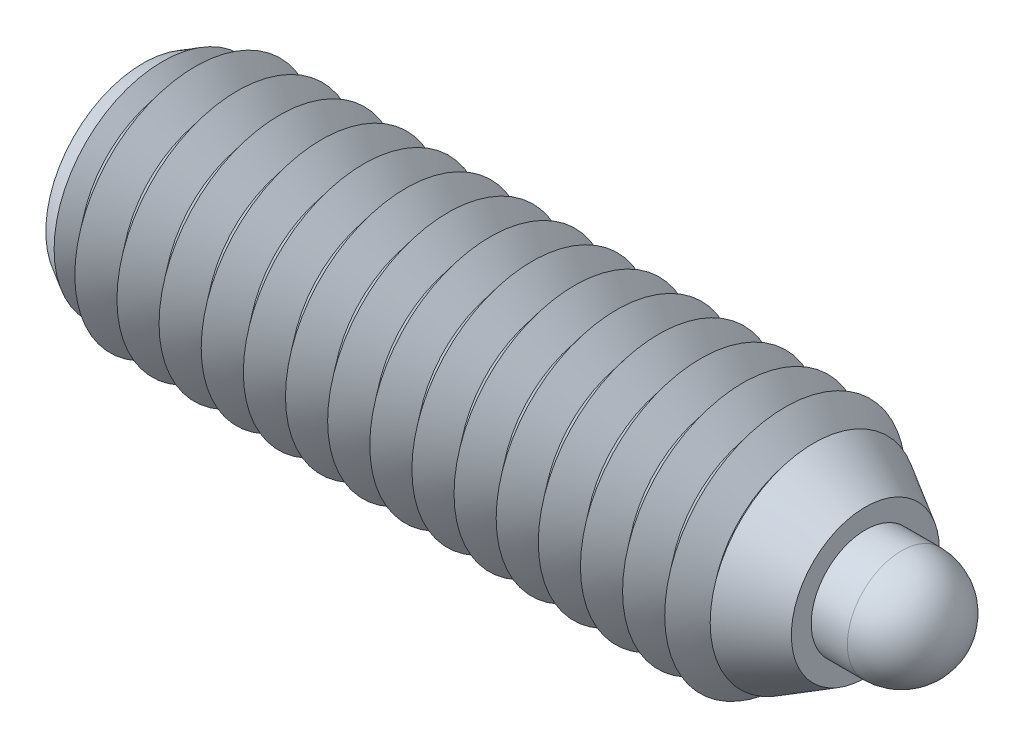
ISO-10303-21;
HEADER;
FILE_DESCRIPTION(('STEP AP214'),'2;1');
FILE_NAME('part.step','',(''),(''),'','','');
FILE_SCHEMA(('AUTOMOTIVE_DESIGN { 1 0 10303 214 1 1 1 1 }'));
ENDSEC;
DATA;
#1=APPLICATION_CONTEXT('core data for automotive mechanical design processes');
#2=APPLICATION_PROTOCOL_DEFINITION('international standard','automotive_design',2000,#1);
#3=PRODUCT_CONTEXT('',#1,'mechanical');
#4=PRODUCT('Part','Part','',(#3));
#5=PRODUCT_RELATED_PRODUCT_CATEGORY('part','',(#4));
#6=PRODUCT_DEFINITION_FORMATION('','',#4);
#7=PRODUCT_DEFINITION_CONTEXT('part definition',#1,'design');
#8=PRODUCT_DEFINITION('design','',#6,#7);
#9=PRODUCT_DEFINITION_SHAPE('','',#8);
#10=(LENGTH_UNIT() NAMED_UNIT(*) SI_UNIT(.MILLI.,.METRE.));
#11=(NAMED_UNIT(*) PLANE_ANGLE_UNIT() SI_UNIT($,.RADIAN.));
#12=(NAMED_UNIT(*) SI_UNIT($,.STERADIAN.) SOLID_ANGLE_UNIT());
#13=UNCERTAINTY_MEASURE_WITH_UNIT(LENGTH_MEASURE(1.E-05),#10,'distance_accuracy_value','');
#14=(GEOMETRIC_REPRESENTATION_CONTEXT(3) GLOBAL_UNCERTAINTY_ASSIGNED_CONTEXT((#13)) GLOBAL_UNIT_ASSIGNED_CONTEXT((#10,
#11,#12)) REPRESENTATION_CONTEXT('',''));
#15=CARTESIAN_POINT('',(0.,0.,0.));
#16=DIRECTION('',(0.,0.,1.));
#17=DIRECTION('',(1.,0.,0.));
#18=AXIS2_PLACEMENT_3D('',#15,#16,#17);
#19=CARTESIAN_POINT('',(11.15,0.,0.));
#20=DIRECTION('',(-1.,0.,0.));
#21=DIRECTION('',(0.,0.,1.));
#22=AXIS2_PLACEMENT_3D('',#19,#20,#21);
#23=CYLINDRICAL_SURFACE('',#22,1.26);
#24=CARTESIAN_POINT('',(9.23000000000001,0.,0.));
#25=DIRECTION('',(1.,0.,0.));
#26=DIRECTION('',(0.,0.,-1.));
#27=AXIS2_PLACEMENT_3D('',#24,#25,#26);
#28=CIRCLE('',#27,1.26);
#29=CARTESIAN_POINT('',(9.23000000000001,0.,-1.26));
#30=VERTEX_POINT('',#29);
#31=EDGE_CURVE('P0_E21',#30,#30,#28,.T.);
#32=ORIENTED_EDGE('',*,*,#31,.T.);
#33=EDGE_LOOP('',(#32));
#34=FACE_BOUND('',#33,.T.);
#35=CARTESIAN_POINT('',(10.79,0.,0.));
#36=DIRECTION('',(1.,0.,0.));
#37=DIRECTION('',(0.,0.,-1.));
#38=AXIS2_PLACEMENT_3D('',#35,#36,#37);
#39=CIRCLE('',#38,1.26);
#40=CARTESIAN_POINT('',(10.79,0.,-1.26));
#41=VERTEX_POINT('',#40);
#42=EDGE_CURVE('P0_E25',#41,#41,#39,.F.);
#43=ORIENTED_EDGE('',*,*,#42,.T.);
#44=EDGE_LOOP('',(#43));
#45=FACE_BOUND('',#44,.T.);
#46=ADVANCED_FACE('P0_F14',(#34,#45),#23,.T.);
#47=CARTESIAN_POINT('',(8.75,0.,0.));
#48=DIRECTION('',(1.,0.,0.));
#49=DIRECTION('',(0.,0.,-1.));
#50=AXIS2_PLACEMENT_3D('',#47,#48,#49);
#51=PLANE('',#50);
#52=CARTESIAN_POINT('',(8.75,0.,0.));
#53=DIRECTION('',(1.,0.,0.));
#54=DIRECTION('',(0.,0.,-1.));
#55=AXIS2_PLACEMENT_3D('',#52,#53,#54);
#56=CIRCLE('',#55,1.13138438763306);
#57=CARTESIAN_POINT('',(8.75,0.,-1.13138438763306));
#58=VERTEX_POINT('',#57);
#59=EDGE_CURVE('P0_E10',#58,#58,#56,.F.);
#60=ORIENTED_EDGE('',*,*,#59,.T.);
#61=EDGE_LOOP('',(#60));
#62=FACE_BOUND('',#61,.T.);
#63=ADVANCED_FACE('P0_F43',(#62),#51,.F.);
#64=CARTESIAN_POINT('',(12.6,0.,0.));
#65=DIRECTION('',(-1.,0.,0.));
#66=DIRECTION('',(0.,0.,1.));
#67=AXIS2_PLACEMENT_3D('',#64,#65,#66);
#68=CYLINDRICAL_SURFACE('',#67,0.9);
#69=CARTESIAN_POINT('',(12.6,0.,0.));
#70=DIRECTION('',(1.,0.,0.));
#71=DIRECTION('',(0.,0.,-1.));
#72=AXIS2_PLACEMENT_3D('',#69,#70,#71);
#73=CIRCLE('',#72,0.9);
#74=CARTESIAN_POINT('',(12.6,0.,-0.899999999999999));
#75=VERTEX_POINT('',#74);
#76=EDGE_CURVE('P0_E29',#75,#75,#73,.T.);
#77=ORIENTED_EDGE('',*,*,#76,.F.);
#78=EDGE_LOOP('',(#77));
#79=FACE_BOUND('',#78,.T.);
#80=CARTESIAN_POINT('',(11.15,0.,0.));
#81=DIRECTION('',(1.,0.,0.));
#82=DIRECTION('',(0.,0.,-1.));
#83=AXIS2_PLACEMENT_3D('',#80,#81,#82);
#84=CIRCLE('',#83,0.9);
#85=CARTESIAN_POINT('',(11.15,0.,-0.899999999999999));
#86=VERTEX_POINT('',#85);
#87=EDGE_CURVE('P0_E32',#86,#86,#84,.T.);
#88=ORIENTED_EDGE('',*,*,#87,.T.);
#89=EDGE_LOOP('',(#88));
#90=FACE_BOUND('',#89,.T.);
#91=ADVANCED_FACE('P0_F40',(#79,#90),#68,.T.);
#92=CARTESIAN_POINT('',(12.6,0.,0.));
#93=DIRECTION('',(-1.,0.,0.));
#94=DIRECTION('',(0.,-1.,0.));
#95=AXIS2_PLACEMENT_3D('',#92,#93,#94);
#96=SPHERICAL_SURFACE('',#95,0.9);
#97=ORIENTED_EDGE('',*,*,#76,.T.);
#98=EDGE_LOOP('',(#97));
#99=FACE_BOUND('',#98,.T.);
#100=ADVANCED_FACE('P0_F38',(#99),#96,.T.);
#101=CARTESIAN_POINT('',(11.15,0.,0.));
#102=DIRECTION('',(-1.,0.,0.));
#103=DIRECTION('',(0.,0.,1.));
#104=AXIS2_PLACEMENT_3D('',#101,#102,#103);
#105=CONICAL_SURFACE('',#104,0.900000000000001,0.785398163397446);
#106=ORIENTED_EDGE('',*,*,#42,.F.);
#107=EDGE_LOOP('',(#106));
#108=FACE_BOUND('',#107,.T.);
#109=ORIENTED_EDGE('',*,*,#87,.F.);
#110=EDGE_LOOP('',(#109));
#111=FACE_BOUND('',#110,.T.);
#112=ADVANCED_FACE('P0_F47',(#108,#111),#105,.T.);
#113=CARTESIAN_POINT('',(9.23000000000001,0.,0.));
#114=DIRECTION('',(1.,0.,0.));
#115=DIRECTION('',(0.,0.,-1.));
#116=AXIS2_PLACEMENT_3D('',#113,#114,#115);
#117=CONICAL_SURFACE('',#116,1.26,0.261799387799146);
#118=ORIENTED_EDGE('',*,*,#59,.F.);
#119=EDGE_LOOP('',(#118));
#120=FACE_BOUND('',#119,.T.);
#121=ORIENTED_EDGE('',*,*,#31,.F.);
#122=EDGE_LOOP('',(#121));
#123=FACE_BOUND('',#122,.T.);
#124=ADVANCED_FACE('P0_F16',(#120,#123),#117,.T.);
#125=CLOSED_SHELL('',(#46,#63,#91,#100,#112,#124));
#126=MANIFOLD_SOLID_BREP('P0_B1',#125);
#127=CARTESIAN_POINT('',(12.,0.,0.));
#128=DIRECTION('',(-1.,0.,0.));
#129=DIRECTION('',(0.,0.,1.));
#130=AXIS2_PLACEMENT_3D('',#127,#128,#129);
#131=CONICAL_SURFACE('',#130,1.23,0.523598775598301);
#132=CARTESIAN_POINT('',(12.,0.,0.));
#133=DIRECTION('',(1.,0.,0.));
#134=DIRECTION('',(0.,0.,-1.));
#135=AXIS2_PLACEMENT_3D('',#132,#133,#134);
#136=CIRCLE('',#135,1.23);
#137=CARTESIAN_POINT('',(12.,0.,-1.23));
#138=VERTEX_POINT('',#137);
#139=EDGE_CURVE('P1_E326',#138,#138,#136,.T.);
#140=ORIENTED_EDGE('',*,*,#139,.F.);
#141=EDGE_LOOP('',(#140));
#142=FACE_BOUND('',#141,.T.);
#143=CARTESIAN_POINT('',(11.1450351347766,0.,0.));
#144=DIRECTION('',(1.,0.,0.));
#145=DIRECTION('',(0.,0.,-1.));
#146=AXIS2_PLACEMENT_3D('',#143,#144,#145);
#147=CIRCLE('',#146,1.72361419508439);
#148=CARTESIAN_POINT('',(11.1450351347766,0.,-1.72361419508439));
#149=VERTEX_POINT('',#148);
#150=EDGE_CURVE('P1_E330',#149,#149,#147,.T.);
#151=ORIENTED_EDGE('',*,*,#150,.T.);
#152=EDGE_LOOP('',(#151));
#153=FACE_BOUND('',#152,.T.);
#154=ADVANCED_FACE('P1_F15',(#142,#153),#131,.T.);
#155=CARTESIAN_POINT('',(12.,0.,0.));
#156=DIRECTION('',(1.,0.,0.));
#157=DIRECTION('',(0.,0.,-1.));
#158=AXIS2_PLACEMENT_3D('',#155,#156,#157);
#159=PLANE('',#158);
#160=ORIENTED_EDGE('',*,*,#139,.T.);
#161=EDGE_LOOP('',(#160));
#162=FACE_BOUND('',#161,.T.);
#163=CARTESIAN_POINT('',(12.,0.,0.));
#164=DIRECTION('',(1.,0.,0.));
#165=DIRECTION('',(0.,0.,-1.));
#166=AXIS2_PLACEMENT_3D('',#163,#164,#165);
#167=CIRCLE('',#166,0.900000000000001);
#168=CARTESIAN_POINT('',(12.,0.,-0.899999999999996));
#169=VERTEX_POINT('',#168);
#170=EDGE_CURVE('P1_E333',#169,#169,#167,.T.);
#171=ORIENTED_EDGE('',*,*,#170,.F.);
#172=EDGE_LOOP('',(#171));
#173=FACE_BOUND('',#172,.T.);
#174=ADVANCED_FACE('P1_F188',(#162,#173),#159,.T.);
#175=CARTESIAN_POINT('',(3.6,0.,0.));
#176=DIRECTION('',(-1.,0.,0.));
#177=DIRECTION('',(0.,0.,1.));
#178=AXIS2_PLACEMENT_3D('',#175,#176,#177);
#179=PLANE('',#178);
#180=CARTESIAN_POINT('',(3.6,0.,0.));
#181=DIRECTION('',(1.,0.,0.));
#182=DIRECTION('',(0.,0.,-1.));
#183=AXIS2_PLACEMENT_3D('',#180,#181,#182);
#184=CIRCLE('',#183,1.26);
#185=CARTESIAN_POINT('',(3.6,0.,-1.26));
#186=VERTEX_POINT('',#185);
#187=EDGE_CURVE('P1_E434',#186,#186,#184,.T.);
#188=ORIENTED_EDGE('',*,*,#187,.T.);
#189=EDGE_LOOP('',(#188));
#190=FACE_BOUND('',#189,.T.);
#191=ADVANCED_FACE('P1_F194',(#190),#179,.F.);
#192=CARTESIAN_POINT('',(12.,0.,0.));
#193=DIRECTION('',(1.,0.,0.));
#194=DIRECTION('',(0.,0.,-1.));
#195=AXIS2_PLACEMENT_3D('',#192,#193,#194);
#196=CYLINDRICAL_SURFACE('',#195,1.26);
#197=ORIENTED_EDGE('',*,*,#187,.F.);
#198=EDGE_LOOP('',(#197));
#199=FACE_BOUND('',#198,.T.);
#200=CARTESIAN_POINT('',(10.8,0.,0.));
#201=DIRECTION('',(1.,0.,0.));
#202=DIRECTION('',(0.,0.,-1.));
#203=AXIS2_PLACEMENT_3D('',#200,#201,#202);
#204=CIRCLE('',#203,1.26);
#205=CARTESIAN_POINT('',(10.8,0.,-1.26));
#206=VERTEX_POINT('',#205);
#207=EDGE_CURVE('P1_E432',#206,#206,#204,.T.);
#208=ORIENTED_EDGE('',*,*,#207,.T.);
#209=EDGE_LOOP('',(#208));
#210=FACE_BOUND('',#209,.T.);
#211=ADVANCED_FACE('P1_F739',(#199,#210),#196,.F.);
#212=CARTESIAN_POINT('',(12.,0.,0.));
#213=DIRECTION('',(-1.,0.,0.));
#214=DIRECTION('',(0.,0.,1.));
#215=AXIS2_PLACEMENT_3D('',#212,#213,#214);
#216=CONICAL_SURFACE('',#215,0.900000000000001,0.291456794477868);
#217=ORIENTED_EDGE('',*,*,#207,.F.);
#218=EDGE_LOOP('',(#217));
#219=FACE_BOUND('',#218,.T.);
#220=ORIENTED_EDGE('',*,*,#170,.T.);
#221=EDGE_LOOP('',(#220));
#222=FACE_BOUND('',#221,.T.);
#223=ADVANCED_FACE('P1_F731',(#219,#222),#216,.F.);
#224=CARTESIAN_POINT('',(11.016320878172,0.,0.));
#225=DIRECTION('',(1.,0.,0.));
#226=DIRECTION('',(0.,0.,-1.));
#227=AXIS2_PLACEMENT_3D('',#224,#225,#226);
#228=CONICAL_SURFACE('',#227,1.56285014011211,0.89566479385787);
#229=ORIENTED_EDGE('',*,*,#150,.F.);
#230=EDGE_LOOP('',(#229));
#231=FACE_BOUND('',#230,.T.);
#232=CARTESIAN_POINT('',(11.016320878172,0.,0.));
#233=DIRECTION('',(-1.,0.,0.));
#234=DIRECTION('',(0.,0.,1.));
#235=AXIS2_PLACEMENT_3D('',#232,#233,#234);
#236=CIRCLE('',#235,1.56285014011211);
#237=CARTESIAN_POINT('',(11.016320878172,0.,1.56285014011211));
#238=VERTEX_POINT('',#237);
#239=EDGE_CURVE('P1_E334',#238,#238,#236,.T.);
#240=ORIENTED_EDGE('',*,*,#239,.F.);
#241=EDGE_LOOP('',(#240));
#242=FACE_BOUND('',#241,.T.);
#243=ADVANCED_FACE('P1_F723',(#231,#242),#228,.T.);
#244=CARTESIAN_POINT('',(10.666320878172,0.,0.));
#245=DIRECTION('',(-1.,0.,0.));
#246=DIRECTION('',(0.,0.,1.));
#247=AXIS2_PLACEMENT_3D('',#244,#245,#246);
#248=CONICAL_SURFACE('',#247,2.,0.895664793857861);
#249=ORIENTED_EDGE('',*,*,#239,.T.);
#250=EDGE_LOOP('',(#249));
#251=FACE_BOUND('',#250,.T.);
#252=CARTESIAN_POINT('',(10.666320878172,0.,0.));
#253=DIRECTION('',(-1.,0.,0.));
#254=DIRECTION('',(0.,0.,1.));
#255=AXIS2_PLACEMENT_3D('',#252,#253,#254);
#256=CIRCLE('',#255,2.);
#257=CARTESIAN_POINT('',(10.666320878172,0.,2.));
#258=VERTEX_POINT('',#257);
#259=EDGE_CURVE('P1_E425',#258,#258,#256,.T.);
#260=ORIENTED_EDGE('',*,*,#259,.F.);
#261=EDGE_LOOP('',(#260));
#262=FACE_BOUND('',#261,.T.);
#263=ADVANCED_FACE('P1_F715',(#251,#262),#248,.T.);
#264=CARTESIAN_POINT('',(10.316320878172,0.,0.));
#265=DIRECTION('',(1.,0.,0.));
#266=DIRECTION('',(0.,0.,-1.));
#267=AXIS2_PLACEMENT_3D('',#264,#265,#266);
#268=CONICAL_SURFACE('',#267,1.56285014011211,0.89566479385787);
#269=ORIENTED_EDGE('',*,*,#259,.T.);
#270=EDGE_LOOP('',(#269));
#271=FACE_BOUND('',#270,.T.);
#272=CARTESIAN_POINT('',(10.316320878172,0.,0.));
#273=DIRECTION('',(-1.,0.,0.));
#274=DIRECTION('',(0.,0.,1.));
#275=AXIS2_PLACEMENT_3D('',#272,#273,#274);
#276=CIRCLE('',#275,1.56285014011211);
#277=CARTESIAN_POINT('',(10.316320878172,0.,1.56285014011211));
#278=VERTEX_POINT('',#277);
#279=EDGE_CURVE('P1_E422',#278,#278,#276,.T.);
#280=ORIENTED_EDGE('',*,*,#279,.F.);
#281=EDGE_LOOP('',(#280));
#282=FACE_BOUND('',#281,.T.);
#283=ADVANCED_FACE('P1_F707',(#271,#282),#268,.T.);
#284=CARTESIAN_POINT('',(9.96632087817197,0.,0.));
#285=DIRECTION('',(-1.,0.,0.));
#286=DIRECTION('',(0.,0.,1.));
#287=AXIS2_PLACEMENT_3D('',#284,#285,#286);
#288=CONICAL_SURFACE('',#287,2.,0.895664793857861);
#289=ORIENTED_EDGE('',*,*,#279,.T.);
#290=EDGE_LOOP('',(#289));
#291=FACE_BOUND('',#290,.T.);
#292=CARTESIAN_POINT('',(9.96632087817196,0.,0.));
#293=DIRECTION('',(-1.,0.,0.));
#294=DIRECTION('',(0.,0.,1.));
#295=AXIS2_PLACEMENT_3D('',#292,#293,#294);
#296=CIRCLE('',#295,2.);
#297=CARTESIAN_POINT('',(9.96632087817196,0.,2.));
#298=VERTEX_POINT('',#297);
#299=EDGE_CURVE('P1_E419',#298,#298,#296,.T.);
#300=ORIENTED_EDGE('',*,*,#299,.F.);
#301=EDGE_LOOP('',(#300));
#302=FACE_BOUND('',#301,.T.);
#303=ADVANCED_FACE('P1_F699',(#291,#302),#288,.T.);
#304=CARTESIAN_POINT('',(9.61632087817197,0.,0.));
#305=DIRECTION('',(1.,0.,0.));
#306=DIRECTION('',(0.,0.,-1.));
#307=AXIS2_PLACEMENT_3D('',#304,#305,#306);
#308=CONICAL_SURFACE('',#307,1.56285014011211,0.89566479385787);
#309=ORIENTED_EDGE('',*,*,#299,.T.);
#310=EDGE_LOOP('',(#309));
#311=FACE_BOUND('',#310,.T.);
#312=CARTESIAN_POINT('',(9.61632087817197,0.,0.));
#313=DIRECTION('',(-1.,0.,0.));
#314=DIRECTION('',(0.,0.,1.));
#315=AXIS2_PLACEMENT_3D('',#312,#313,#314);
#316=CIRCLE('',#315,1.56285014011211);
#317=CARTESIAN_POINT('',(9.61632087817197,0.,1.56285014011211));
#318=VERTEX_POINT('',#317);
#319=EDGE_CURVE('P1_E416',#318,#318,#316,.T.);
#320=ORIENTED_EDGE('',*,*,#319,.F.);
#321=EDGE_LOOP('',(#320));
#322=FACE_BOUND('',#321,.T.);
#323=ADVANCED_FACE('P1_F691',(#311,#322),#308,.T.);
#324=CARTESIAN_POINT('',(9.26632087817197,0.,0.));
#325=DIRECTION('',(-1.,0.,0.));
#326=DIRECTION('',(0.,0.,1.));
#327=AXIS2_PLACEMENT_3D('',#324,#325,#326);
#328=CONICAL_SURFACE('',#327,2.,0.895664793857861);
#329=ORIENTED_EDGE('',*,*,#319,.T.);
#330=EDGE_LOOP('',(#329));
#331=FACE_BOUND('',#330,.T.);
#332=CARTESIAN_POINT('',(9.26632087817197,0.,0.));
#333=DIRECTION('',(-1.,0.,0.));
#334=DIRECTION('',(0.,0.,1.));
#335=AXIS2_PLACEMENT_3D('',#332,#333,#334);
#336=CIRCLE('',#335,2.);
#337=CARTESIAN_POINT('',(9.26632087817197,0.,2.));
#338=VERTEX_POINT('',#337);
#339=EDGE_CURVE('P1_E413',#338,#338,#336,.T.);
#340=ORIENTED_EDGE('',*,*,#339,.F.);
#341=EDGE_LOOP('',(#340));
#342=FACE_BOUND('',#341,.T.);
#343=ADVANCED_FACE('P1_F683',(#331,#342),#328,.T.);
#344=CARTESIAN_POINT('',(8.91632087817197,0.,0.));
#345=DIRECTION('',(1.,0.,0.));
#346=DIRECTION('',(0.,0.,-1.));
#347=AXIS2_PLACEMENT_3D('',#344,#345,#346);
#348=CONICAL_SURFACE('',#347,1.56285014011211,0.89566479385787);
#349=ORIENTED_EDGE('',*,*,#339,.T.);
#350=EDGE_LOOP('',(#349));
#351=FACE_BOUND('',#350,.T.);
#352=CARTESIAN_POINT('',(8.91632087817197,0.,0.));
#353=DIRECTION('',(-1.,0.,0.));
#354=DIRECTION('',(0.,0.,1.));
#355=AXIS2_PLACEMENT_3D('',#352,#353,#354);
#356=CIRCLE('',#355,1.56285014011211);
#357=CARTESIAN_POINT('',(8.91632087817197,0.,1.56285014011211));
#358=VERTEX_POINT('',#357);
#359=EDGE_CURVE('P1_E410',#358,#358,#356,.T.);
#360=ORIENTED_EDGE('',*,*,#359,.F.);
#361=EDGE_LOOP('',(#360));
#362=FACE_BOUND('',#361,.T.);
#363=ADVANCED_FACE('P1_F675',(#351,#362),#348,.T.);
#364=CARTESIAN_POINT('',(8.56632087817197,0.,0.));
#365=DIRECTION('',(-1.,0.,0.));
#366=DIRECTION('',(0.,0.,1.));
#367=AXIS2_PLACEMENT_3D('',#364,#365,#366);
#368=CONICAL_SURFACE('',#367,2.,0.895664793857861);
#369=ORIENTED_EDGE('',*,*,#359,.T.);
#370=EDGE_LOOP('',(#369));
#371=FACE_BOUND('',#370,.T.);
#372=CARTESIAN_POINT('',(8.56632087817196,0.,0.));
#373=DIRECTION('',(-1.,0.,0.));
#374=DIRECTION('',(0.,0.,1.));
#375=AXIS2_PLACEMENT_3D('',#372,#373,#374);
#376=CIRCLE('',#375,2.);
#377=CARTESIAN_POINT('',(8.56632087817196,0.,2.));
#378=VERTEX_POINT('',#377);
#379=EDGE_CURVE('P1_E407',#378,#378,#376,.T.);
#380=ORIENTED_EDGE('',*,*,#379,.F.);
#381=EDGE_LOOP('',(#380));
#382=FACE_BOUND('',#381,.T.);
#383=ADVANCED_FACE('P1_F667',(#371,#382),#368,.T.);
#384=CARTESIAN_POINT('',(8.21632087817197,0.,0.));
#385=DIRECTION('',(1.,0.,0.));
#386=DIRECTION('',(0.,0.,-1.));
#387=AXIS2_PLACEMENT_3D('',#384,#385,#386);
#388=CONICAL_SURFACE('',#387,1.56285014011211,0.89566479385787);
#389=ORIENTED_EDGE('',*,*,#379,.T.);
#390=EDGE_LOOP('',(#389));
#391=FACE_BOUND('',#390,.T.);
#392=CARTESIAN_POINT('',(8.21632087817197,0.,0.));
#393=DIRECTION('',(-1.,0.,0.));
#394=DIRECTION('',(0.,0.,1.));
#395=AXIS2_PLACEMENT_3D('',#392,#393,#394);
#396=CIRCLE('',#395,1.56285014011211);
#397=CARTESIAN_POINT('',(8.21632087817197,0.,1.56285014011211));
#398=VERTEX_POINT('',#397);
#399=EDGE_CURVE('P1_E404',#398,#398,#396,.T.);
#400=ORIENTED_EDGE('',*,*,#399,.F.);
#401=EDGE_LOOP('',(#400));
#402=FACE_BOUND('',#401,.T.);
#403=ADVANCED_FACE('P1_F659',(#391,#402),#388,.T.);
#404=CARTESIAN_POINT('',(7.86632087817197,0.,0.));
#405=DIRECTION('',(-1.,0.,0.));
#406=DIRECTION('',(0.,0.,1.));
#407=AXIS2_PLACEMENT_3D('',#404,#405,#406);
#408=CONICAL_SURFACE('',#407,2.,0.895664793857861);
#409=ORIENTED_EDGE('',*,*,#399,.T.);
#410=EDGE_LOOP('',(#409));
#411=FACE_BOUND('',#410,.T.);
#412=CARTESIAN_POINT('',(7.86632087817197,0.,0.));
#413=DIRECTION('',(-1.,0.,0.));
#414=DIRECTION('',(0.,0.,1.));
#415=AXIS2_PLACEMENT_3D('',#412,#413,#414);
#416=CIRCLE('',#415,2.);
#417=CARTESIAN_POINT('',(7.86632087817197,0.,2.));
#418=VERTEX_POINT('',#417);
#419=EDGE_CURVE('P1_E401',#418,#418,#416,.T.);
#420=ORIENTED_EDGE('',*,*,#419,.F.);
#421=EDGE_LOOP('',(#420));
#422=FACE_BOUND('',#421,.T.);
#423=ADVANCED_FACE('P1_F651',(#411,#422),#408,.T.);
#424=CARTESIAN_POINT('',(7.51632087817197,0.,0.));
#425=DIRECTION('',(1.,0.,0.));
#426=DIRECTION('',(0.,0.,-1.));
#427=AXIS2_PLACEMENT_3D('',#424,#425,#426);
#428=CONICAL_SURFACE('',#427,1.56285014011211,0.89566479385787);
#429=ORIENTED_EDGE('',*,*,#419,.T.);
#430=EDGE_LOOP('',(#429));
#431=FACE_BOUND('',#430,.T.);
#432=CARTESIAN_POINT('',(7.51632087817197,0.,0.));
#433=DIRECTION('',(-1.,0.,0.));
#434=DIRECTION('',(0.,0.,1.));
#435=AXIS2_PLACEMENT_3D('',#432,#433,#434);
#436=CIRCLE('',#435,1.56285014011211);
#437=CARTESIAN_POINT('',(7.51632087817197,0.,1.56285014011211));
#438=VERTEX_POINT('',#437);
#439=EDGE_CURVE('P1_E398',#438,#438,#436,.T.);
#440=ORIENTED_EDGE('',*,*,#439,.F.);
#441=EDGE_LOOP('',(#440));
#442=FACE_BOUND('',#441,.T.);
#443=ADVANCED_FACE('P1_F643',(#431,#442),#428,.T.);
#444=CARTESIAN_POINT('',(7.16632087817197,0.,0.));
#445=DIRECTION('',(-1.,0.,0.));
#446=DIRECTION('',(0.,0.,1.));
#447=AXIS2_PLACEMENT_3D('',#444,#445,#446);
#448=CONICAL_SURFACE('',#447,2.,0.895664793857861);
#449=ORIENTED_EDGE('',*,*,#439,.T.);
#450=EDGE_LOOP('',(#449));
#451=FACE_BOUND('',#450,.T.);
#452=CARTESIAN_POINT('',(7.16632087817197,0.,0.));
#453=DIRECTION('',(-1.,0.,0.));
#454=DIRECTION('',(0.,0.,1.));
#455=AXIS2_PLACEMENT_3D('',#452,#453,#454);
#456=CIRCLE('',#455,2.);
#457=CARTESIAN_POINT('',(7.16632087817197,0.,2.));
#458=VERTEX_POINT('',#457);
#459=EDGE_CURVE('P1_E395',#458,#458,#456,.T.);
#460=ORIENTED_EDGE('',*,*,#459,.F.);
#461=EDGE_LOOP('',(#460));
#462=FACE_BOUND('',#461,.T.);
#463=ADVANCED_FACE('P1_F635',(#451,#462),#448,.T.);
#464=CARTESIAN_POINT('',(6.81632087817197,0.,0.));
#465=DIRECTION('',(1.,0.,0.));
#466=DIRECTION('',(0.,0.,-1.));
#467=AXIS2_PLACEMENT_3D('',#464,#465,#466);
#468=CONICAL_SURFACE('',#467,1.56285014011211,0.89566479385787);
#469=ORIENTED_EDGE('',*,*,#459,.T.);
#470=EDGE_LOOP('',(#469));
#471=FACE_BOUND('',#470,.T.);
#472=CARTESIAN_POINT('',(6.81632087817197,0.,0.));
#473=DIRECTION('',(-1.,0.,0.));
#474=DIRECTION('',(0.,0.,1.));
#475=AXIS2_PLACEMENT_3D('',#472,#473,#474);
#476=CIRCLE('',#475,1.56285014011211);
#477=CARTESIAN_POINT('',(6.81632087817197,0.,1.56285014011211));
#478=VERTEX_POINT('',#477);
#479=EDGE_CURVE('P1_E392',#478,#478,#476,.T.);
#480=ORIENTED_EDGE('',*,*,#479,.F.);
#481=EDGE_LOOP('',(#480));
#482=FACE_BOUND('',#481,.T.);
#483=ADVANCED_FACE('P1_F627',(#471,#482),#468,.T.);
#484=CARTESIAN_POINT('',(6.46632087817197,0.,0.));
#485=DIRECTION('',(-1.,0.,0.));
#486=DIRECTION('',(0.,0.,1.));
#487=AXIS2_PLACEMENT_3D('',#484,#485,#486);
#488=CONICAL_SURFACE('',#487,2.,0.895664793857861);
#489=ORIENTED_EDGE('',*,*,#479,.T.);
#490=EDGE_LOOP('',(#489));
#491=FACE_BOUND('',#490,.T.);
#492=CARTESIAN_POINT('',(6.46632087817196,0.,0.));
#493=DIRECTION('',(-1.,0.,0.));
#494=DIRECTION('',(0.,0.,1.));
#495=AXIS2_PLACEMENT_3D('',#492,#493,#494);
#496=CIRCLE('',#495,2.);
#497=CARTESIAN_POINT('',(6.46632087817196,0.,2.));
#498=VERTEX_POINT('',#497);
#499=EDGE_CURVE('P1_E389',#498,#498,#496,.T.);
#500=ORIENTED_EDGE('',*,*,#499,.F.);
#501=EDGE_LOOP('',(#500));
#502=FACE_BOUND('',#501,.T.);
#503=ADVANCED_FACE('P1_F619',(#491,#502),#488,.T.);
#504=CARTESIAN_POINT('',(6.11632087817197,0.,0.));
#505=DIRECTION('',(1.,0.,0.));
#506=DIRECTION('',(0.,0.,-1.));
#507=AXIS2_PLACEMENT_3D('',#504,#505,#506);
#508=CONICAL_SURFACE('',#507,1.56285014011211,0.89566479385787);
#509=ORIENTED_EDGE('',*,*,#499,.T.);
#510=EDGE_LOOP('',(#509));
#511=FACE_BOUND('',#510,.T.);
#512=CARTESIAN_POINT('',(6.11632087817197,0.,0.));
#513=DIRECTION('',(-1.,0.,0.));
#514=DIRECTION('',(0.,0.,1.));
#515=AXIS2_PLACEMENT_3D('',#512,#513,#514);
#516=CIRCLE('',#515,1.56285014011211);
#517=CARTESIAN_POINT('',(6.11632087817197,0.,1.56285014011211));
#518=VERTEX_POINT('',#517);
#519=EDGE_CURVE('P1_E386',#518,#518,#516,.T.);
#520=ORIENTED_EDGE('',*,*,#519,.F.);
#521=EDGE_LOOP('',(#520));
#522=FACE_BOUND('',#521,.T.);
#523=ADVANCED_FACE('P1_F611',(#511,#522),#508,.T.);
#524=CARTESIAN_POINT('',(5.76632087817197,0.,0.));
#525=DIRECTION('',(-1.,0.,0.));
#526=DIRECTION('',(0.,0.,1.));
#527=AXIS2_PLACEMENT_3D('',#524,#525,#526);
#528=CONICAL_SURFACE('',#527,2.,0.895664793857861);
#529=ORIENTED_EDGE('',*,*,#519,.T.);
#530=EDGE_LOOP('',(#529));
#531=FACE_BOUND('',#530,.T.);
#532=CARTESIAN_POINT('',(5.76632087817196,0.,0.));
#533=DIRECTION('',(-1.,0.,0.));
#534=DIRECTION('',(0.,0.,1.));
#535=AXIS2_PLACEMENT_3D('',#532,#533,#534);
#536=CIRCLE('',#535,2.);
#537=CARTESIAN_POINT('',(5.76632087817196,0.,2.));
#538=VERTEX_POINT('',#537);
#539=EDGE_CURVE('P1_E383',#538,#538,#536,.T.);
#540=ORIENTED_EDGE('',*,*,#539,.F.);
#541=EDGE_LOOP('',(#540));
#542=FACE_BOUND('',#541,.T.);
#543=ADVANCED_FACE('P1_F603',(#531,#542),#528,.T.);
#544=CARTESIAN_POINT('',(5.41632087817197,0.,0.));
#545=DIRECTION('',(1.,0.,0.));
#546=DIRECTION('',(0.,0.,-1.));
#547=AXIS2_PLACEMENT_3D('',#544,#545,#546);
#548=CONICAL_SURFACE('',#547,1.56285014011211,0.89566479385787);
#549=ORIENTED_EDGE('',*,*,#539,.T.);
#550=EDGE_LOOP('',(#549));
#551=FACE_BOUND('',#550,.T.);
#552=CARTESIAN_POINT('',(5.41632087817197,0.,0.));
#553=DIRECTION('',(-1.,0.,0.));
#554=DIRECTION('',(0.,0.,1.));
#555=AXIS2_PLACEMENT_3D('',#552,#553,#554);
#556=CIRCLE('',#555,1.56285014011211);
#557=CARTESIAN_POINT('',(5.41632087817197,0.,1.56285014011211));
#558=VERTEX_POINT('',#557);
#559=EDGE_CURVE('P1_E380',#558,#558,#556,.T.);
#560=ORIENTED_EDGE('',*,*,#559,.F.);
#561=EDGE_LOOP('',(#560));
#562=FACE_BOUND('',#561,.T.);
#563=ADVANCED_FACE('P1_F595',(#551,#562),#548,.T.);
#564=CARTESIAN_POINT('',(5.06632087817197,0.,0.));
#565=DIRECTION('',(-1.,0.,0.));
#566=DIRECTION('',(0.,0.,1.));
#567=AXIS2_PLACEMENT_3D('',#564,#565,#566);
#568=CONICAL_SURFACE('',#567,2.,0.895664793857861);
#569=ORIENTED_EDGE('',*,*,#559,.T.);
#570=EDGE_LOOP('',(#569));
#571=FACE_BOUND('',#570,.T.);
#572=CARTESIAN_POINT('',(5.06632087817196,0.,0.));
#573=DIRECTION('',(-1.,0.,0.));
#574=DIRECTION('',(0.,0.,1.));
#575=AXIS2_PLACEMENT_3D('',#572,#573,#574);
#576=CIRCLE('',#575,2.);
#577=CARTESIAN_POINT('',(5.06632087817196,0.,2.));
#578=VERTEX_POINT('',#577);
#579=EDGE_CURVE('P1_E377',#578,#578,#576,.T.);
#580=ORIENTED_EDGE('',*,*,#579,.F.);
#581=EDGE_LOOP('',(#580));
#582=FACE_BOUND('',#581,.T.);
#583=ADVANCED_FACE('P1_F587',(#571,#582),#568,.T.);
#584=CARTESIAN_POINT('',(4.71632087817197,0.,0.));
#585=DIRECTION('',(1.,0.,0.));
#586=DIRECTION('',(0.,0.,-1.));
#587=AXIS2_PLACEMENT_3D('',#584,#585,#586);
#588=CONICAL_SURFACE('',#587,1.56285014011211,0.89566479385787);
#589=ORIENTED_EDGE('',*,*,#579,.T.);
#590=EDGE_LOOP('',(#589));
#591=FACE_BOUND('',#590,.T.);
#592=CARTESIAN_POINT('',(4.71632087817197,0.,0.));
#593=DIRECTION('',(-1.,0.,0.));
#594=DIRECTION('',(0.,0.,1.));
#595=AXIS2_PLACEMENT_3D('',#592,#593,#594);
#596=CIRCLE('',#595,1.56285014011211);
#597=CARTESIAN_POINT('',(4.71632087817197,0.,1.56285014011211));
#598=VERTEX_POINT('',#597);
#599=EDGE_CURVE('P1_E374',#598,#598,#596,.T.);
#600=ORIENTED_EDGE('',*,*,#599,.F.);
#601=EDGE_LOOP('',(#600));
#602=FACE_BOUND('',#601,.T.);
#603=ADVANCED_FACE('P1_F579',(#591,#602),#588,.T.);
#604=CARTESIAN_POINT('',(4.36632087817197,0.,0.));
#605=DIRECTION('',(-1.,0.,0.));
#606=DIRECTION('',(0.,0.,1.));
#607=AXIS2_PLACEMENT_3D('',#604,#605,#606);
#608=CONICAL_SURFACE('',#607,2.,0.895664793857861);
#609=ORIENTED_EDGE('',*,*,#599,.T.);
#610=EDGE_LOOP('',(#609));
#611=FACE_BOUND('',#610,.T.);
#612=CARTESIAN_POINT('',(4.36632087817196,0.,0.));
#613=DIRECTION('',(-1.,0.,0.));
#614=DIRECTION('',(0.,0.,1.));
#615=AXIS2_PLACEMENT_3D('',#612,#613,#614);
#616=CIRCLE('',#615,2.);
#617=CARTESIAN_POINT('',(4.36632087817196,0.,2.));
#618=VERTEX_POINT('',#617);
#619=EDGE_CURVE('P1_E371',#618,#618,#616,.T.);
#620=ORIENTED_EDGE('',*,*,#619,.F.);
#621=EDGE_LOOP('',(#620));
#622=FACE_BOUND('',#621,.T.);
#623=ADVANCED_FACE('P1_F571',(#611,#622),#608,.T.);
#624=CARTESIAN_POINT('',(4.01632087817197,0.,0.));
#625=DIRECTION('',(1.,0.,0.));
#626=DIRECTION('',(0.,0.,-1.));
#627=AXIS2_PLACEMENT_3D('',#624,#625,#626);
#628=CONICAL_SURFACE('',#627,1.56285014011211,0.89566479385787);
#629=ORIENTED_EDGE('',*,*,#619,.T.);
#630=EDGE_LOOP('',(#629));
#631=FACE_BOUND('',#630,.T.);
#632=CARTESIAN_POINT('',(4.01632087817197,0.,0.));
#633=DIRECTION('',(-1.,0.,0.));
#634=DIRECTION('',(0.,0.,1.));
#635=AXIS2_PLACEMENT_3D('',#632,#633,#634);
#636=CIRCLE('',#635,1.56285014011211);
#637=CARTESIAN_POINT('',(4.01632087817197,0.,1.56285014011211));
#638=VERTEX_POINT('',#637);
#639=EDGE_CURVE('P1_E368',#638,#638,#636,.T.);
#640=ORIENTED_EDGE('',*,*,#639,.F.);
#641=EDGE_LOOP('',(#640));
#642=FACE_BOUND('',#641,.T.);
#643=ADVANCED_FACE('P1_F563',(#631,#642),#628,.T.);
#644=CARTESIAN_POINT('',(3.66632087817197,0.,0.));
#645=DIRECTION('',(-1.,0.,0.));
#646=DIRECTION('',(0.,0.,1.));
#647=AXIS2_PLACEMENT_3D('',#644,#645,#646);
#648=CONICAL_SURFACE('',#647,2.,0.895664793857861);
#649=ORIENTED_EDGE('',*,*,#639,.T.);
#650=EDGE_LOOP('',(#649));
#651=FACE_BOUND('',#650,.T.);
#652=CARTESIAN_POINT('',(3.66632087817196,0.,0.));
#653=DIRECTION('',(-1.,0.,0.));
#654=DIRECTION('',(0.,0.,1.));
#655=AXIS2_PLACEMENT_3D('',#652,#653,#654);
#656=CIRCLE('',#655,2.);
#657=CARTESIAN_POINT('',(3.66632087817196,0.,2.));
#658=VERTEX_POINT('',#657);
#659=EDGE_CURVE('P1_E365',#658,#658,#656,.T.);
#660=ORIENTED_EDGE('',*,*,#659,.F.);
#661=EDGE_LOOP('',(#660));
#662=FACE_BOUND('',#661,.T.);
#663=ADVANCED_FACE('P1_F555',(#651,#662),#648,.T.);
#664=CARTESIAN_POINT('',(3.31632087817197,0.,0.));
#665=DIRECTION('',(1.,0.,0.));
#666=DIRECTION('',(0.,0.,-1.));
#667=AXIS2_PLACEMENT_3D('',#664,#665,#666);
#668=CONICAL_SURFACE('',#667,1.56285014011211,0.89566479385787);
#669=ORIENTED_EDGE('',*,*,#659,.T.);
#670=EDGE_LOOP('',(#669));
#671=FACE_BOUND('',#670,.T.);
#672=CARTESIAN_POINT('',(3.31632087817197,0.,0.));
#673=DIRECTION('',(-1.,0.,0.));
#674=DIRECTION('',(0.,0.,1.));
#675=AXIS2_PLACEMENT_3D('',#672,#673,#674);
#676=CIRCLE('',#675,1.56285014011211);
#677=CARTESIAN_POINT('',(3.31632087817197,0.,1.56285014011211));
#678=VERTEX_POINT('',#677);
#679=EDGE_CURVE('P1_E362',#678,#678,#676,.T.);
#680=ORIENTED_EDGE('',*,*,#679,.F.);
#681=EDGE_LOOP('',(#680));
#682=FACE_BOUND('',#681,.T.);
#683=ADVANCED_FACE('P1_F547',(#671,#682),#668,.T.);
#684=CARTESIAN_POINT('',(2.96632087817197,0.,0.));
#685=DIRECTION('',(-1.,0.,0.));
#686=DIRECTION('',(0.,0.,1.));
#687=AXIS2_PLACEMENT_3D('',#684,#685,#686);
#688=CONICAL_SURFACE('',#687,2.,0.895664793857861);
#689=ORIENTED_EDGE('',*,*,#679,.T.);
#690=EDGE_LOOP('',(#689));
#691=FACE_BOUND('',#690,.T.);
#692=CARTESIAN_POINT('',(2.96632087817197,0.,0.));
#693=DIRECTION('',(-1.,0.,0.));
#694=DIRECTION('',(0.,0.,1.));
#695=AXIS2_PLACEMENT_3D('',#692,#693,#694);
#696=CIRCLE('',#695,2.);
#697=CARTESIAN_POINT('',(2.96632087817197,0.,2.));
#698=VERTEX_POINT('',#697);
#699=EDGE_CURVE('P1_E359',#698,#698,#696,.T.);
#700=ORIENTED_EDGE('',*,*,#699,.F.);
#701=EDGE_LOOP('',(#700));
#702=FACE_BOUND('',#701,.T.);
#703=ADVANCED_FACE('P1_F539',(#691,#702),#688,.T.);
#704=CARTESIAN_POINT('',(2.61632087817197,0.,0.));
#705=DIRECTION('',(1.,0.,0.));
#706=DIRECTION('',(0.,0.,-1.));
#707=AXIS2_PLACEMENT_3D('',#704,#705,#706);
#708=CONICAL_SURFACE('',#707,1.56285014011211,0.89566479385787);
#709=ORIENTED_EDGE('',*,*,#699,.T.);
#710=EDGE_LOOP('',(#709));
#711=FACE_BOUND('',#710,.T.);
#712=CARTESIAN_POINT('',(2.61632087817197,0.,0.));
#713=DIRECTION('',(-1.,0.,0.));
#714=DIRECTION('',(0.,0.,1.));
#715=AXIS2_PLACEMENT_3D('',#712,#713,#714);
#716=CIRCLE('',#715,1.56285014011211);
#717=CARTESIAN_POINT('',(2.61632087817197,0.,1.56285014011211));
#718=VERTEX_POINT('',#717);
#719=EDGE_CURVE('P1_E356',#718,#718,#716,.T.);
#720=ORIENTED_EDGE('',*,*,#719,.F.);
#721=EDGE_LOOP('',(#720));
#722=FACE_BOUND('',#721,.T.);
#723=ADVANCED_FACE('P1_F531',(#711,#722),#708,.T.);
#724=CARTESIAN_POINT('',(2.26632087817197,0.,0.));
#725=DIRECTION('',(-1.,0.,0.));
#726=DIRECTION('',(0.,0.,1.));
#727=AXIS2_PLACEMENT_3D('',#724,#725,#726);
#728=CONICAL_SURFACE('',#727,2.,0.895664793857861);
#729=ORIENTED_EDGE('',*,*,#719,.T.);
#730=EDGE_LOOP('',(#729));
#731=FACE_BOUND('',#730,.T.);
#732=CARTESIAN_POINT('',(2.26632087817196,0.,0.));
#733=DIRECTION('',(-1.,0.,0.));
#734=DIRECTION('',(0.,0.,1.));
#735=AXIS2_PLACEMENT_3D('',#732,#733,#734);
#736=CIRCLE('',#735,2.);
#737=CARTESIAN_POINT('',(2.26632087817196,0.,2.));
#738=VERTEX_POINT('',#737);
#739=EDGE_CURVE('P1_E353',#738,#738,#736,.T.);
#740=ORIENTED_EDGE('',*,*,#739,.F.);
#741=EDGE_LOOP('',(#740));
#742=FACE_BOUND('',#741,.T.);
#743=ADVANCED_FACE('P1_F523',(#731,#742),#728,.T.);
#744=CARTESIAN_POINT('',(1.91632087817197,0.,0.));
#745=DIRECTION('',(1.,0.,0.));
#746=DIRECTION('',(0.,0.,-1.));
#747=AXIS2_PLACEMENT_3D('',#744,#745,#746);
#748=CONICAL_SURFACE('',#747,1.56285014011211,0.89566479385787);
#749=ORIENTED_EDGE('',*,*,#739,.T.);
#750=EDGE_LOOP('',(#749));
#751=FACE_BOUND('',#750,.T.);
#752=CARTESIAN_POINT('',(1.91632087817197,0.,0.));
#753=DIRECTION('',(-1.,0.,0.));
#754=DIRECTION('',(0.,0.,1.));
#755=AXIS2_PLACEMENT_3D('',#752,#753,#754);
#756=CIRCLE('',#755,1.56285014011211);
#757=CARTESIAN_POINT('',(1.91632087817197,0.,1.56285014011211));
#758=VERTEX_POINT('',#757);
#759=EDGE_CURVE('P1_E350',#758,#758,#756,.T.);
#760=ORIENTED_EDGE('',*,*,#759,.F.);
#761=EDGE_LOOP('',(#760));
#762=FACE_BOUND('',#761,.T.);
#763=ADVANCED_FACE('P1_F515',(#751,#762),#748,.T.);
#764=CARTESIAN_POINT('',(1.56632087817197,0.,0.));
#765=DIRECTION('',(-1.,0.,0.));
#766=DIRECTION('',(0.,0.,1.));
#767=AXIS2_PLACEMENT_3D('',#764,#765,#766);
#768=CONICAL_SURFACE('',#767,2.,0.895664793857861);
#769=ORIENTED_EDGE('',*,*,#759,.T.);
#770=EDGE_LOOP('',(#769));
#771=FACE_BOUND('',#770,.T.);
#772=CARTESIAN_POINT('',(1.56632087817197,0.,0.));
#773=DIRECTION('',(-1.,0.,0.));
#774=DIRECTION('',(0.,0.,1.));
#775=AXIS2_PLACEMENT_3D('',#772,#773,#774);
#776=CIRCLE('',#775,2.);
#777=CARTESIAN_POINT('',(1.56632087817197,0.,2.));
#778=VERTEX_POINT('',#777);
#779=EDGE_CURVE('P1_E342',#778,#778,#776,.T.);
#780=ORIENTED_EDGE('',*,*,#779,.F.);
#781=EDGE_LOOP('',(#780));
#782=FACE_BOUND('',#781,.T.);
#783=ADVANCED_FACE('P1_F507',(#771,#782),#768,.T.);
#784=CARTESIAN_POINT('',(1.21632087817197,0.,0.));
#785=DIRECTION('',(1.,0.,0.));
#786=DIRECTION('',(0.,0.,-1.));
#787=AXIS2_PLACEMENT_3D('',#784,#785,#786);
#788=CONICAL_SURFACE('',#787,1.56285014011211,0.89566479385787);
#789=ORIENTED_EDGE('',*,*,#779,.T.);
#790=EDGE_LOOP('',(#789));
#791=FACE_BOUND('',#790,.T.);
#792=CARTESIAN_POINT('',(1.21632087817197,0.,0.));
#793=DIRECTION('',(-1.,0.,0.));
#794=DIRECTION('',(0.,0.,1.));
#795=AXIS2_PLACEMENT_3D('',#792,#793,#794);
#796=CIRCLE('',#795,1.56285014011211);
#797=CARTESIAN_POINT('',(1.21632087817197,0.,1.56285014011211));
#798=VERTEX_POINT('',#797);
#799=EDGE_CURVE('P1_E338',#798,#798,#796,.T.);
#800=ORIENTED_EDGE('',*,*,#799,.F.);
#801=EDGE_LOOP('',(#800));
#802=FACE_BOUND('',#801,.T.);
#803=ADVANCED_FACE('P1_F499',(#791,#802),#788,.T.);
#804=CARTESIAN_POINT('',(0.866320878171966,0.,0.));
#805=DIRECTION('',(-1.,0.,0.));
#806=DIRECTION('',(0.,0.,1.));
#807=AXIS2_PLACEMENT_3D('',#804,#805,#806);
#808=CONICAL_SURFACE('',#807,2.,0.895664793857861);
#809=ORIENTED_EDGE('',*,*,#799,.T.);
#810=EDGE_LOOP('',(#809));
#811=FACE_BOUND('',#810,.T.);
#812=CARTESIAN_POINT('',(0.866320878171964,0.,0.));
#813=DIRECTION('',(-1.,0.,0.));
#814=DIRECTION('',(0.,0.,1.));
#815=AXIS2_PLACEMENT_3D('',#812,#813,#814);
#816=CIRCLE('',#815,2.);
#817=CARTESIAN_POINT('',(0.866320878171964,0.,2.));
#818=VERTEX_POINT('',#817);
#819=EDGE_CURVE('P1_E126',#818,#818,#816,.T.);
#820=ORIENTED_EDGE('',*,*,#819,.F.);
#821=EDGE_LOOP('',(#820));
#822=FACE_BOUND('',#821,.T.);
#823=ADVANCED_FACE('P1_F493',(#811,#822),#808,.T.);
#824=CARTESIAN_POINT('',(0.516320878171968,0.,0.));
#825=DIRECTION('',(1.,0.,0.));
#826=DIRECTION('',(0.,0.,-1.));
#827=AXIS2_PLACEMENT_3D('',#824,#825,#826);
#828=CONICAL_SURFACE('',#827,1.56285014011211,0.89566479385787);
#829=ORIENTED_EDGE('',*,*,#819,.T.);
#830=EDGE_LOOP('',(#829));
#831=FACE_BOUND('',#830,.T.);
#832=CARTESIAN_POINT('',(0.516320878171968,0.,0.));
#833=DIRECTION('',(-1.,0.,0.));
#834=DIRECTION('',(0.,0.,1.));
#835=AXIS2_PLACEMENT_3D('',#832,#833,#834);
#836=CIRCLE('',#835,1.56285014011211);
#837=CARTESIAN_POINT('',(0.516320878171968,0.,1.56285014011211));
#838=VERTEX_POINT('',#837);
#839=EDGE_CURVE('P1_E123',#838,#838,#836,.T.);
#840=ORIENTED_EDGE('',*,*,#839,.F.);
#841=EDGE_LOOP('',(#840));
#842=FACE_BOUND('',#841,.T.);
#843=ADVANCED_FACE('P1_F486',(#831,#842),#828,.T.);
#844=CARTESIAN_POINT('',(0.166320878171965,0.,0.));
#845=DIRECTION('',(-1.,0.,0.));
#846=DIRECTION('',(0.,0.,1.));
#847=AXIS2_PLACEMENT_3D('',#844,#845,#846);
#848=CONICAL_SURFACE('',#847,2.,0.895664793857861);
#849=CARTESIAN_POINT('',(0.324546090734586,0.,0.));
#850=DIRECTION('',(-1.,0.,0.));
#851=DIRECTION('',(0.,0.,1.));
#852=AXIS2_PLACEMENT_3D('',#849,#850,#851);
#853=CIRCLE('',#852,1.80237677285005);
#854=CARTESIAN_POINT('',(0.324546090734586,0.,-1.80237677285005));
#855=VERTEX_POINT('',#854);
#856=EDGE_CURVE('P1_E336',#855,#855,#853,.T.);
#857=ORIENTED_EDGE('',*,*,#856,.F.);
#858=EDGE_LOOP('',(#857));
#859=FACE_BOUND('',#858,.T.);
#860=ORIENTED_EDGE('',*,*,#839,.T.);
#861=EDGE_LOOP('',(#860));
#862=FACE_BOUND('',#861,.T.);
#863=ADVANCED_FACE('P1_F145',(#859,#862),#848,.T.);
#864=CARTESIAN_POINT('',(0.,0.,0.));
#865=DIRECTION('',(1.,0.,0.));
#866=DIRECTION('',(0.,0.,-1.));
#867=AXIS2_PLACEMENT_3D('',#864,#865,#866);
#868=PLANE('',#867);
#869=CARTESIAN_POINT('',(0.,0.,0.));
#870=DIRECTION('',(1.,0.,0.));
#871=DIRECTION('',(0.,0.,-1.));
#872=AXIS2_PLACEMENT_3D('',#869,#870,#871);
#873=CIRCLE('',#872,1.615);
#874=CARTESIAN_POINT('',(0.,0.,-1.615));
#875=VERTEX_POINT('',#874);
#876=EDGE_CURVE('P1_E249',#875,#875,#873,.F.);
#877=ORIENTED_EDGE('',*,*,#876,.T.);
#878=EDGE_LOOP('',(#877));
#879=FACE_BOUND('',#878,.T.);
#880=CARTESIAN_POINT('',(0.,0.,0.));
#881=DIRECTION('',(1.,0.,0.));
#882=DIRECTION('',(0.,0.,-1.));
#883=AXIS2_PLACEMENT_3D('',#880,#881,#882);
#884=CIRCLE('',#883,1.15470053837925);
#885=CARTESIAN_POINT('',(0.,-0.57735026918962,-1.));
#886=VERTEX_POINT('',#885);
#887=CARTESIAN_POINT('',(0.,0.57735026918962,-1.));
#888=VERTEX_POINT('',#887);
#889=EDGE_CURVE('P1_E19',#886,#888,#884,.T.);
#890=ORIENTED_EDGE('',*,*,#889,.T.);
#891=CARTESIAN_POINT('',(0.,1.15470053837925,0.));
#892=VERTEX_POINT('',#891);
#893=EDGE_CURVE('P1_E10',#888,#892,#884,.T.);
#894=ORIENTED_EDGE('',*,*,#893,.T.);
#895=CARTESIAN_POINT('',(0.,0.,0.));
#896=DIRECTION('',(-1.,0.,0.));
#897=DIRECTION('',(0.,0.,1.));
#898=AXIS2_PLACEMENT_3D('',#895,#896,#897);
#899=CIRCLE('',#898,1.15470053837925);
#900=CARTESIAN_POINT('',(0.,0.577350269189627,0.999999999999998));
#901=VERTEX_POINT('',#900);
#902=EDGE_CURVE('P1_E35',#901,#892,#899,.T.);
#903=ORIENTED_EDGE('',*,*,#902,.F.);
#904=CARTESIAN_POINT('',(0.,-0.577350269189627,0.999999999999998));
#905=VERTEX_POINT('',#904);
#906=EDGE_CURVE('P1_E24',#901,#905,#884,.T.);
#907=ORIENTED_EDGE('',*,*,#906,.T.);
#908=CARTESIAN_POINT('',(0.,-1.15470053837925,0.));
#909=VERTEX_POINT('',#908);
#910=EDGE_CURVE('P1_E250',#905,#909,#884,.T.);
#911=ORIENTED_EDGE('',*,*,#910,.T.);
#912=EDGE_CURVE('P1_E245',#909,#886,#884,.T.);
#913=ORIENTED_EDGE('',*,*,#912,.T.);
#914=EDGE_LOOP('',(#890,#894,#903,#907,#911,#913));
#915=FACE_BOUND('',#914,.T.);
#916=ADVANCED_FACE('P1_F103',(#879,#915),#868,.F.);
#917=CARTESIAN_POINT('',(0.666839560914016,0.,0.));
#918=DIRECTION('',(1.,0.,0.));
#919=DIRECTION('',(0.,0.,-1.));
#920=AXIS2_PLACEMENT_3D('',#917,#918,#919);
#921=CONICAL_SURFACE('',#920,2.,0.5235987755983);
#922=CARTESIAN_POINT('',(0.,0.,-1.615));
#923=CARTESIAN_POINT('',(0.00338068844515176,0.,-1.61695184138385));
#924=CARTESIAN_POINT('',(0.0067613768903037,0.,-1.61890368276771));
#925=CARTESIAN_POINT('',(0.0135227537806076,0.,-1.62280736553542));
#926=CARTESIAN_POINT('',(0.0169034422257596,0.,-1.62475920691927));
#927=CARTESIAN_POINT('',(0.0236648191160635,0.,-1.62866288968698));
#928=CARTESIAN_POINT('',(0.0270455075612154,0.,-1.63061473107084));
#929=CARTESIAN_POINT('',(0.0338068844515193,0.,-1.63451841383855));
#930=CARTESIAN_POINT('',(0.0371875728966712,0.,-1.6364702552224));
#931=CARTESIAN_POINT('',(0.0439489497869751,0.,-1.64037393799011));
#932=CARTESIAN_POINT('',(0.047329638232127,0.,-1.64232577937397));
#933=CARTESIAN_POINT('',(0.0540910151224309,0.,-1.64622946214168));
#934=CARTESIAN_POINT('',(0.0574717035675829,0.,-1.64818130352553));
#935=CARTESIAN_POINT('',(0.0642330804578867,0.,-1.65208498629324));
#936=CARTESIAN_POINT('',(0.0676137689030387,0.,-1.65403682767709));
#937=CARTESIAN_POINT('',(0.0743751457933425,0.,-1.6579405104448));
#938=CARTESIAN_POINT('',(0.0777558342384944,0.,-1.65989235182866));
#939=CARTESIAN_POINT('',(0.0845172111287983,0.,-1.66379603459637));
#940=CARTESIAN_POINT('',(0.0878978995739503,0.,-1.66574787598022));
#941=CARTESIAN_POINT('',(0.0946592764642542,0.,-1.66965155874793));
#942=CARTESIAN_POINT('',(0.0980399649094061,0.,-1.67160340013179));
#943=CARTESIAN_POINT('',(0.10480134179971,0.,-1.6755070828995));
#944=CARTESIAN_POINT('',(0.108182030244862,0.,-1.67745892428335));
#945=CARTESIAN_POINT('',(0.114943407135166,0.,-1.68136260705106));
#946=CARTESIAN_POINT('',(0.118324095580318,0.,-1.68331444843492));
#947=CARTESIAN_POINT('',(0.125085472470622,0.,-1.68721813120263));
#948=CARTESIAN_POINT('',(0.128466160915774,0.,-1.68916997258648));
#949=CARTESIAN_POINT('',(0.135227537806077,0.,-1.69307365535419));
#950=CARTESIAN_POINT('',(0.138608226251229,0.,-1.69502549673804));
#951=CARTESIAN_POINT('',(0.145369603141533,0.,-1.69892917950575));
#952=CARTESIAN_POINT('',(0.148750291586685,0.,-1.70088102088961));
#953=CARTESIAN_POINT('',(0.155511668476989,0.,-1.70478470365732));
#954=CARTESIAN_POINT('',(0.158892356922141,0.,-1.70673654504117));
#955=CARTESIAN_POINT('',(0.165653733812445,0.,-1.71064022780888));
#956=CARTESIAN_POINT('',(0.169034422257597,0.,-1.71259206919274));
#957=CARTESIAN_POINT('',(0.175795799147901,0.,-1.71649575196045));
#958=CARTESIAN_POINT('',(0.179176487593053,0.,-1.7184475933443));
#959=CARTESIAN_POINT('',(0.185937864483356,0.,-1.72235127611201));
#960=CARTESIAN_POINT('',(0.189318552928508,0.,-1.72430311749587));
#961=CARTESIAN_POINT('',(0.196079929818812,0.,-1.72820680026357));
#962=CARTESIAN_POINT('',(0.199460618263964,0.,-1.73015864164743));
#963=CARTESIAN_POINT('',(0.206221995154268,0.,-1.73406232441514));
#964=CARTESIAN_POINT('',(0.20960268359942,0.,-1.73601416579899));
#965=CARTESIAN_POINT('',(0.216364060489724,0.,-1.7399178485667));
#966=CARTESIAN_POINT('',(0.219744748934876,0.,-1.74186968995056));
#967=CARTESIAN_POINT('',(0.22650612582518,0.,-1.74577337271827));
#968=CARTESIAN_POINT('',(0.229886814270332,0.,-1.74772521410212));
#969=CARTESIAN_POINT('',(0.236648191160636,0.,-1.75162889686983));
#970=CARTESIAN_POINT('',(0.240028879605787,0.,-1.75358073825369));
#971=CARTESIAN_POINT('',(0.246790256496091,0.,-1.7574844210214));
#972=CARTESIAN_POINT('',(0.250170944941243,0.,-1.75943626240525));
#973=CARTESIAN_POINT('',(0.256932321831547,0.,-1.76333994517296));
#974=CARTESIAN_POINT('',(0.260313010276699,0.,-1.76529178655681));
#975=CARTESIAN_POINT('',(0.267074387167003,0.,-1.76919546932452));
#976=CARTESIAN_POINT('',(0.270455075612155,0.,-1.77114731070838));
#977=CARTESIAN_POINT('',(0.277216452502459,0.,-1.77505099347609));
#978=CARTESIAN_POINT('',(0.280597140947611,0.,-1.77700283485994));
#979=CARTESIAN_POINT('',(0.287358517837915,0.,-1.78090651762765));
#980=CARTESIAN_POINT('',(0.290739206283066,0.,-1.78285835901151));
#981=CARTESIAN_POINT('',(0.29750058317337,0.,-1.78676204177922));
#982=CARTESIAN_POINT('',(0.300881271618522,0.,-1.78871388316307));
#983=CARTESIAN_POINT('',(0.307642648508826,0.,-1.79261756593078));
#984=CARTESIAN_POINT('',(0.311023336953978,0.,-1.79456940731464));
#985=CARTESIAN_POINT('',(0.317784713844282,0.,-1.79847309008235));
#986=CARTESIAN_POINT('',(0.321165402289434,0.,-1.8004249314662));
#987=CARTESIAN_POINT('',(0.324546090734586,0.,-1.80237677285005));
#988=B_SPLINE_CURVE_WITH_KNOTS('',3,(#922,#923,#924,#925,#926,#927,#928,#929,#930,#931,#932,
#933,#934,#935,#936,#937,#938,#939,#940,#941,#942,#943,#944,#945,#946,#947,#948,#949,#950,#951,
#952,#953,#954,#955,#956,#957,#958,#959,#960,#961,#962,#963,#964,#965,#966,#967,#968,#969,#970,
#971,#972,#973,#974,#975,#976,#977,#978,#979,#980,#981,#982,#983,#984,#985,#986,#987),
.UNSPECIFIED.,.F.,.F.,(4,2,2,2,2,2,2,2,2,2,2,2,2,2,2,2,2,2,2,2,2,2,2,2,2,2,2,2,2,2,2,2,4),(0.,
0.0117110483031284,0.0234220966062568,0.0351331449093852,0.0468441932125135,0.058555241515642,
0.0702662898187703,0.0819773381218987,0.0936883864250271,0.105399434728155,0.117110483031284,
0.128821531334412,0.140532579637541,0.152243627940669,0.163954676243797,0.175665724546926,
0.187376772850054,0.199087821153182,0.210798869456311,0.222509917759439,0.234220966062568,
0.245932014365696,0.257643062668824,0.269354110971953,0.281065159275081,0.29277620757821,
0.304487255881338,0.316198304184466,0.327909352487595,0.339620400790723,0.351331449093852,
0.36304249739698,0.374753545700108),.UNSPECIFIED.);
#989=EDGE_CURVE('P1_BSEAM17',#875,#855,#988,.T.);
#990=ORIENTED_EDGE('',*,*,#876,.F.);
#991=ORIENTED_EDGE('',*,*,#856,.T.);
#992=ORIENTED_EDGE('',*,*,#989,.T.);
#993=ORIENTED_EDGE('',*,*,#989,.F.);
#994=EDGE_LOOP('',(#990,#992,#991,#993));
#995=FACE_BOUND('',#994,.T.);
#996=ADVANCED_FACE('P1_F17',(#995),#921,.T.);
#997=CARTESIAN_POINT('',(0.,0.,0.));
#998=DIRECTION('',(-1.,0.,0.));
#999=DIRECTION('',(0.,0.,1.));
#1000=AXIS2_PLACEMENT_3D('',#997,#998,#999);
#1001=CONICAL_SURFACE('',#1000,1.15470053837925,1.0471975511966);
#1002=ORIENTED_EDGE('',*,*,#889,.F.);
#1003=CARTESIAN_POINT('',(-0.371835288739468,-1.49514512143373,-1.));
#1004=CARTESIAN_POINT('',(-0.351115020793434,-1.4519612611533,-1.));
#1005=CARTESIAN_POINT('',(-0.330613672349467,-1.40867282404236,-1.));
#1006=CARTESIAN_POINT('',(-0.290163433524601,-1.32182947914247,-1.));
#1007=CARTESIAN_POINT('',(-0.27021464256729,-1.27827452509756,-1.));
#1008=CARTESIAN_POINT('',(-0.211145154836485,-1.14662339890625,-1.));
#1009=CARTESIAN_POINT('',(-0.173052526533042,-1.05805724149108,-1.));
#1010=CARTESIAN_POINT('',(-0.100245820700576,-0.876833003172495,-1.));
#1011=CARTESIAN_POINT('',(-0.0656458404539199,-0.784128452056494,-1.));
#1012=CARTESIAN_POINT('',(-0.00407347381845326,-0.59633174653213,-1.));
#1013=CARTESIAN_POINT('',(0.0229187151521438,-0.501246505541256,-1.));
#1014=CARTESIAN_POINT('',(0.0542242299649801,-0.356699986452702,-1.));
#1015=CARTESIAN_POINT('',(0.0631249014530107,-0.308244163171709,-1.));
#1016=CARTESIAN_POINT('',(0.0772575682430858,-0.210788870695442,-1.));
#1017=CARTESIAN_POINT('',(0.082489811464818,-0.161789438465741,-1.));
#1018=CARTESIAN_POINT('',(0.0888010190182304,-0.0641060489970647,-1.));
#1019=CARTESIAN_POINT('',(0.0899289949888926,-0.0154253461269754,-1.));
#1020=CARTESIAN_POINT('',(0.0880670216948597,0.0818553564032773,-1.));
#1021=CARTESIAN_POINT('',(0.0850768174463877,0.130455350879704,-1.));
#1022=CARTESIAN_POINT('',(0.0728816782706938,0.250369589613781,-1.));
#1023=CARTESIAN_POINT('',(0.0613914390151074,0.32145191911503,-1.));
#1024=CARTESIAN_POINT('',(0.0317596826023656,0.462229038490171,-1.));
#1025=CARTESIAN_POINT('',(0.0136101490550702,0.531922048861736,-1.));
#1026=CARTESIAN_POINT('',(-0.0278697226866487,0.67141572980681,-1.));
#1027=CARTESIAN_POINT('',(-0.0513071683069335,0.741183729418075,-1.));
#1028=CARTESIAN_POINT('',(-0.101564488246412,0.879438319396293,-1.));
#1029=CARTESIAN_POINT('',(-0.12838317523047,0.947925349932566,-1.));
#1030=CARTESIAN_POINT('',(-0.200053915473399,1.12214515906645,-1.));
#1031=CARTESIAN_POINT('',(-0.246572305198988,1.22718574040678,-1.));
#1032=CARTESIAN_POINT('',(-0.342876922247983,1.43575968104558,-1.));
#1033=CARTESIAN_POINT('',(-0.392663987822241,1.53929264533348,-1.));
#1034=CARTESIAN_POINT('',(-0.494336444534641,1.74546702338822,-1.));
#1035=CARTESIAN_POINT('',(-0.546224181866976,1.84810727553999,-1.));
#1036=CARTESIAN_POINT('',(-0.651338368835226,2.05270058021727,-1.));
#1037=CARTESIAN_POINT('',(-0.704564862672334,2.15465360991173,-1.));
#1038=CARTESIAN_POINT('',(-0.806866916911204,2.34846553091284,-1.));
#1039=CARTESIAN_POINT('',(-0.855859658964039,2.44036823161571,-1.));
#1040=CARTESIAN_POINT('',(-0.954403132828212,2.62387799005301,-1.));
#1041=CARTESIAN_POINT('',(-1.00395388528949,2.71548503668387,-1.));
#1042=CARTESIAN_POINT('',(-1.10334710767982,2.89823865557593,-1.));
#1043=CARTESIAN_POINT('',(-1.15318851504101,2.98938580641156,-1.));
#1044=CARTESIAN_POINT('',(-1.25319572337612,3.17149583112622,-1.));
#1045=CARTESIAN_POINT('',(-1.30336150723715,3.26245871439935,-1.));
#1046=CARTESIAN_POINT('',(-1.35364621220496,3.35335539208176,-1.));
#1047=B_SPLINE_CURVE_WITH_KNOTS('',3,(#1003,#1004,#1005,#1006,#1007,#1008,#1009,#1010,#1011,
#1012,#1013,#1014,#1015,#1016,#1017,#1018,#1019,#1020,#1021,#1022,#1023,#1024,#1025,#1026,#1027,
#1028,#1029,#1030,#1031,#1032,#1033,#1034,#1035,#1036,#1037,#1038,#1039,#1040,#1041,#1042,#1043,
#1044,#1045,#1046),.UNSPECIFIED.,.F.,.F.,(4,2,2,2,2,2,2,2,2,2,2,2,2,2,2,2,2,2,2,2,2,4),(0.,
0.143690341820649,0.287406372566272,0.57656033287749,0.873259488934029,1.16917907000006,
1.31686338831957,1.46453772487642,1.61044269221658,1.75635669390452,1.97192533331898,
2.18775432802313,2.40842600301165,2.62902040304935,2.97355048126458,3.31816926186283,
3.66318417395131,4.00821049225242,4.32064609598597,4.63309330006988,4.94474578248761,
5.25638195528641),.UNSPECIFIED.);
#1048=EDGE_CURVE('P1_E93',#888,#886,#1047,.F.);
#1049=ORIENTED_EDGE('',*,*,#1048,.F.);
#1050=EDGE_LOOP('',(#1002,#1049));
#1051=FACE_BOUND('',#1050,.T.);
#1052=ADVANCED_FACE('P1_F248',(#1051),#1001,.F.);
#1053=ORIENTED_EDGE('',*,*,#912,.F.);
#1054=CARTESIAN_POINT('',(-6.6676665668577E-05,-0.577234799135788,-1.0002));
#1055=CARTESIAN_POINT('',(0.0145910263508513,-0.602607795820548,-0.956252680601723));
#1056=CARTESIAN_POINT('',(0.0279222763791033,-0.628199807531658,-0.911926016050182));
#1057=CARTESIAN_POINT('',(0.0511934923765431,-0.679827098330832,-0.82250492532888));
#1058=CARTESIAN_POINT('',(0.0611252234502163,-0.705863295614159,-0.777408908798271));
#1059=CARTESIAN_POINT('',(0.0765873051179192,-0.757612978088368,-0.687775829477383));
#1060=CARTESIAN_POINT('',(0.0822205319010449,-0.783318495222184,-0.643252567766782));
#1061=CARTESIAN_POINT('',(0.0889487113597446,-0.834850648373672,-0.553996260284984));
#1062=CARTESIAN_POINT('',(0.0900492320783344,-0.860677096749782,-0.509263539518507));
#1063=CARTESIAN_POINT('',(0.0877749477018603,-0.90894626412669,-0.425658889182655));
#1064=CARTESIAN_POINT('',(0.084958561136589,-0.931396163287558,-0.386774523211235));
#1065=CARTESIAN_POINT('',(0.0760275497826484,-0.976149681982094,-0.309259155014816));
#1066=CARTESIAN_POINT('',(0.0699098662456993,-0.998453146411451,-0.270628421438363));
#1067=CARTESIAN_POINT('',(0.0546142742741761,-1.04329913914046,-0.192952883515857));
#1068=CARTESIAN_POINT('',(0.045371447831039,-1.0658359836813,-0.153917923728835));
#1069=CARTESIAN_POINT('',(0.0243931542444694,-1.11057330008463,-0.0764306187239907));
#1070=CARTESIAN_POINT('',(0.0126626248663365,-1.13277434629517,-0.0379772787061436));
#1071=CARTESIAN_POINT('',(-6.66766656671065E-05,-1.15481600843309,0.000199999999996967));
#1072=B_SPLINE_CURVE_WITH_KNOTS('',3,(#1054,#1055,#1056,#1057,#1058,#1059,#1060,#1061,#1062,
#1063,#1064,#1065,#1066,#1067,#1068,#1069,#1070,#1071),.UNSPECIFIED.,.F.,.F.,(4,2,2,2,2,2,2,2,
4),(0.,0.158523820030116,0.317428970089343,0.472400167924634,0.627180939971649,
0.762016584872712,0.896977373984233,1.03493410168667,1.17261952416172),.UNSPECIFIED.);
#1073=EDGE_CURVE('P1_E163',#886,#909,#1072,.T.);
#1074=ORIENTED_EDGE('',*,*,#1073,.F.);
#1075=EDGE_LOOP('',(#1053,#1074));
#1076=FACE_BOUND('',#1075,.T.);
#1077=ADVANCED_FACE('P1_F244',(#1076),#1001,.F.);
#1078=ORIENTED_EDGE('',*,*,#910,.F.);
#1079=CARTESIAN_POINT('',(-6.66766656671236E-05,-1.15481600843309,-0.000200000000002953));
#1080=CARTESIAN_POINT('',(0.0145910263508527,-1.12944301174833,0.0437473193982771));
#1081=CARTESIAN_POINT('',(0.0279222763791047,-1.10385100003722,0.0880739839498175));
#1082=CARTESIAN_POINT('',(0.0511934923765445,-1.05222370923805,0.177495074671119));
#1083=CARTESIAN_POINT('',(0.0611252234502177,-1.02618751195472,0.222591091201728));
#1084=CARTESIAN_POINT('',(0.0765873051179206,-0.97443782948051,0.312224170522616));
#1085=CARTESIAN_POINT('',(0.0822205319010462,-0.948732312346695,0.356747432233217));
#1086=CARTESIAN_POINT('',(0.088948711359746,-0.897200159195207,0.446003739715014));
#1087=CARTESIAN_POINT('',(0.0900492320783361,-0.871373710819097,0.490736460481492));
#1088=CARTESIAN_POINT('',(0.0877749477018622,-0.823104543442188,0.574341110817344));
#1089=CARTESIAN_POINT('',(0.0849585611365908,-0.800654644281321,0.613225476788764));
#1090=CARTESIAN_POINT('',(0.07602754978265,-0.755901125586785,0.690740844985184));
#1091=CARTESIAN_POINT('',(0.0699098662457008,-0.733597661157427,0.729371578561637));
#1092=CARTESIAN_POINT('',(0.0546142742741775,-0.688751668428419,0.807047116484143));
#1093=CARTESIAN_POINT('',(0.0453714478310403,-0.666214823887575,0.846082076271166));
#1094=CARTESIAN_POINT('',(0.0243931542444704,-0.62147750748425,0.92356938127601));
#1095=CARTESIAN_POINT('',(0.0126626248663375,-0.599276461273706,0.962022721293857));
#1096=CARTESIAN_POINT('',(-6.66766656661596E-05,-0.577234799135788,1.0002));
#1097=B_SPLINE_CURVE_WITH_KNOTS('',3,(#1079,#1080,#1081,#1082,#1083,#1084,#1085,#1086,#1087,
#1088,#1089,#1090,#1091,#1092,#1093,#1094,#1095,#1096),.UNSPECIFIED.,.F.,.F.,(4,2,2,2,2,2,2,2,
4),(0.,0.158523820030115,0.317428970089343,0.472400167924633,0.627180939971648,
0.762016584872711,0.896977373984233,1.03493410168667,1.17261952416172),.UNSPECIFIED.);
#1098=EDGE_CURVE('P1_E156',#909,#905,#1097,.T.);
#1099=ORIENTED_EDGE('',*,*,#1098,.F.);
#1100=EDGE_LOOP('',(#1078,#1099));
#1101=FACE_BOUND('',#1100,.T.);
#1102=ADVANCED_FACE('P1_F252',(#1101),#1001,.F.);
#1103=ORIENTED_EDGE('',*,*,#906,.F.);
#1104=CARTESIAN_POINT('',(-0.371835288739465,-1.49514512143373,0.999999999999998));
#1105=CARTESIAN_POINT('',(-0.351115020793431,-1.4519612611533,0.999999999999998));
#1106=CARTESIAN_POINT('',(-0.330613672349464,-1.40867282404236,0.999999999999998));
#1107=CARTESIAN_POINT('',(-0.290163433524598,-1.32182947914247,0.999999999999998));
#1108=CARTESIAN_POINT('',(-0.270214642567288,-1.27827452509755,0.999999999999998));
#1109=CARTESIAN_POINT('',(-0.211145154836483,-1.14662339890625,0.999999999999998));
#1110=CARTESIAN_POINT('',(-0.173052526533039,-1.05805724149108,0.999999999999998));
#1111=CARTESIAN_POINT('',(-0.100245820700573,-0.876833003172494,0.999999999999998));
#1112=CARTESIAN_POINT('',(-0.0656458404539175,-0.784128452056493,0.999999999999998));
#1113=CARTESIAN_POINT('',(-0.00407347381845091,-0.596331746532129,0.999999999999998));
#1114=CARTESIAN_POINT('',(0.0229187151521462,-0.501246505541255,0.999999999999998));
#1115=CARTESIAN_POINT('',(0.0542242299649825,-0.356699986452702,0.999999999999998));
#1116=CARTESIAN_POINT('',(0.0631249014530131,-0.308244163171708,0.999999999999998));
#1117=CARTESIAN_POINT('',(0.0772575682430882,-0.210788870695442,0.999999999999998));
#1118=CARTESIAN_POINT('',(0.0824898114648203,-0.161789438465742,0.999999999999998));
#1119=CARTESIAN_POINT('',(0.0888010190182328,-0.0641060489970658,0.999999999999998));
#1120=CARTESIAN_POINT('',(0.089928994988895,-0.0154253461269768,0.999999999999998));
#1121=CARTESIAN_POINT('',(0.0880670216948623,0.0818553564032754,0.999999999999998));
#1122=CARTESIAN_POINT('',(0.0850768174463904,0.130455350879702,0.999999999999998));
#1123=CARTESIAN_POINT('',(0.0728816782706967,0.250369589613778,0.999999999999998));
#1124=CARTESIAN_POINT('',(0.0613914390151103,0.321451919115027,0.999999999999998));
#1125=CARTESIAN_POINT('',(0.0317596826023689,0.462229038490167,0.999999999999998));
#1126=CARTESIAN_POINT('',(0.0136101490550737,0.531922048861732,0.999999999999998));
#1127=CARTESIAN_POINT('',(-0.0278697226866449,0.671415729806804,0.999999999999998));
#1128=CARTESIAN_POINT('',(-0.0513071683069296,0.741183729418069,0.999999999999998));
#1129=CARTESIAN_POINT('',(-0.101564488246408,0.879438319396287,0.999999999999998));
#1130=CARTESIAN_POINT('',(-0.128383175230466,0.947925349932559,0.999999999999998));
#1131=CARTESIAN_POINT('',(-0.200053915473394,1.12214515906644,0.999999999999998));
#1132=CARTESIAN_POINT('',(-0.246572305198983,1.22718574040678,0.999999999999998));
#1133=CARTESIAN_POINT('',(-0.342876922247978,1.43575968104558,0.999999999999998));
#1134=CARTESIAN_POINT('',(-0.392663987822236,1.53929264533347,0.999999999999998));
#1135=CARTESIAN_POINT('',(-0.494336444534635,1.74546702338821,0.999999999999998));
#1136=CARTESIAN_POINT('',(-0.546224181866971,1.84810727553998,0.999999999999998));
#1137=CARTESIAN_POINT('',(-0.651338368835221,2.05270058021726,0.999999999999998));
#1138=CARTESIAN_POINT('',(-0.704564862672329,2.15465360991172,0.999999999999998));
#1139=CARTESIAN_POINT('',(-0.806866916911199,2.34846553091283,0.999999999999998));
#1140=CARTESIAN_POINT('',(-0.855859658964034,2.44036823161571,0.999999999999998));
#1141=CARTESIAN_POINT('',(-0.954403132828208,2.623877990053,0.999999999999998));
#1142=CARTESIAN_POINT('',(-1.00395388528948,2.71548503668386,0.999999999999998));
#1143=CARTESIAN_POINT('',(-1.10334710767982,2.89823865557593,0.999999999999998));
#1144=CARTESIAN_POINT('',(-1.15318851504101,2.98938580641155,0.999999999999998));
#1145=CARTESIAN_POINT('',(-1.25319572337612,3.17149583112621,0.999999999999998));
#1146=CARTESIAN_POINT('',(-1.30336150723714,3.26245871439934,0.999999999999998));
#1147=CARTESIAN_POINT('',(-1.35364621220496,3.35335539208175,0.999999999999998));
#1148=B_SPLINE_CURVE_WITH_KNOTS('',3,(#1104,#1105,#1106,#1107,#1108,#1109,#1110,#1111,#1112,
#1113,#1114,#1115,#1116,#1117,#1118,#1119,#1120,#1121,#1122,#1123,#1124,#1125,#1126,#1127,#1128,
#1129,#1130,#1131,#1132,#1133,#1134,#1135,#1136,#1137,#1138,#1139,#1140,#1141,#1142,#1143,#1144,
#1145,#1146,#1147),.UNSPECIFIED.,.F.,.F.,(4,2,2,2,2,2,2,2,2,2,2,2,2,2,2,2,2,2,2,2,2,4),(0.,
0.143690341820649,0.287406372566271,0.576560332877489,0.873259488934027,1.16917907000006,
1.31686338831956,1.46453772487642,1.61044269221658,1.75635669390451,1.97192533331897,
2.18775432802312,2.40842600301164,2.62902040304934,2.97355048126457,3.31816926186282,
3.6631841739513,4.00821049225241,4.32064609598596,4.63309330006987,4.9447457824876,
5.2563819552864),.UNSPECIFIED.);
#1149=EDGE_CURVE('P1_E100',#905,#901,#1148,.T.);
#1150=ORIENTED_EDGE('',*,*,#1149,.F.);
#1151=EDGE_LOOP('',(#1103,#1150));
#1152=FACE_BOUND('',#1151,.T.);
#1153=ADVANCED_FACE('P1_F144',(#1152),#1001,.F.);
#1154=ORIENTED_EDGE('',*,*,#902,.T.);
#1155=CARTESIAN_POINT('',(-6.66766656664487E-05,0.577234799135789,1.0002));
#1156=CARTESIAN_POINT('',(0.0145910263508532,0.602607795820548,0.956252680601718));
#1157=CARTESIAN_POINT('',(0.0279222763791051,0.628199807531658,0.911926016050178));
#1158=CARTESIAN_POINT('',(0.0511934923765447,0.679827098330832,0.822504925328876));
#1159=CARTESIAN_POINT('',(0.0611252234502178,0.705863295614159,0.777408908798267));
#1160=CARTESIAN_POINT('',(0.0765873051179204,0.757612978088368,0.68777582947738));
#1161=CARTESIAN_POINT('',(0.082220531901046,0.783318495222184,0.643252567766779));
#1162=CARTESIAN_POINT('',(0.0889487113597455,0.834850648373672,0.553996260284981));
#1163=CARTESIAN_POINT('',(0.0900492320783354,0.860677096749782,0.509263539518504));
#1164=CARTESIAN_POINT('',(0.0877749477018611,0.90894626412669,0.425658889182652));
#1165=CARTESIAN_POINT('',(0.0849585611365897,0.931396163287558,0.386774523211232));
#1166=CARTESIAN_POINT('',(0.0760275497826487,0.976149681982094,0.309259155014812));
#1167=CARTESIAN_POINT('',(0.0699098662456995,0.998453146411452,0.270628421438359));
#1168=CARTESIAN_POINT('',(0.0546142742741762,1.04329913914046,0.192952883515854));
#1169=CARTESIAN_POINT('',(0.045371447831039,1.0658359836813,0.153917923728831));
#1170=CARTESIAN_POINT('',(0.0243931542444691,1.11057330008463,0.0764306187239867));
#1171=CARTESIAN_POINT('',(0.0126626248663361,1.13277434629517,0.0379772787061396));
#1172=CARTESIAN_POINT('',(-6.66766656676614E-05,1.15481600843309,-0.000200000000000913));
#1173=B_SPLINE_CURVE_WITH_KNOTS('',3,(#1155,#1156,#1157,#1158,#1159,#1160,#1161,#1162,#1163,
#1164,#1165,#1166,#1167,#1168,#1169,#1170,#1171,#1172),.UNSPECIFIED.,.F.,.F.,(4,2,2,2,2,2,2,2,
4),(0.,0.158523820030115,0.317428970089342,0.472400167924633,0.627180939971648,0.76201658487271,
0.896977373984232,1.03493410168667,1.17261952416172),.UNSPECIFIED.);
#1174=EDGE_CURVE('P1_E92',#901,#892,#1173,.T.);
#1175=ORIENTED_EDGE('',*,*,#1174,.F.);
#1176=EDGE_LOOP('',(#1154,#1175));
#1177=FACE_BOUND('',#1176,.T.);
#1178=ADVANCED_FACE('P1_F97',(#1177),#1001,.F.);
#1179=ORIENTED_EDGE('',*,*,#893,.F.);
#1180=CARTESIAN_POINT('',(-6.66766656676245E-05,1.15481600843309,0.000199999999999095));
#1181=CARTESIAN_POINT('',(0.0145910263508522,1.12944301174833,-0.0437473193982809));
#1182=CARTESIAN_POINT('',(0.0279222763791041,1.10385100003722,-0.0880739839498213));
#1183=CARTESIAN_POINT('',(0.0511934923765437,1.05222370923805,-0.177495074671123));
#1184=CARTESIAN_POINT('',(0.0611252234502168,1.02618751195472,-0.222591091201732));
#1185=CARTESIAN_POINT('',(0.0765873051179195,0.974437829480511,-0.31222417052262));
#1186=CARTESIAN_POINT('',(0.0822205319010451,0.948732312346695,-0.35674743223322));
#1187=CARTESIAN_POINT('',(0.0889487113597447,0.897200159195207,-0.446003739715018));
#1188=CARTESIAN_POINT('',(0.0900492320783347,0.871373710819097,-0.490736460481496));
#1189=CARTESIAN_POINT('',(0.0877749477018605,0.823104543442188,-0.574341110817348));
#1190=CARTESIAN_POINT('',(0.0849585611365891,0.800654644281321,-0.613225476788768));
#1191=CARTESIAN_POINT('',(0.0760275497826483,0.755901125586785,-0.690740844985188));
#1192=CARTESIAN_POINT('',(0.0699098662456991,0.733597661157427,-0.729371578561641));
#1193=CARTESIAN_POINT('',(0.0546142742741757,0.68875166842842,-0.807047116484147));
#1194=CARTESIAN_POINT('',(0.0453714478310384,0.666214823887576,-0.84608207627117));
#1195=CARTESIAN_POINT('',(0.0243931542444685,0.62147750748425,-0.923569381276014));
#1196=CARTESIAN_POINT('',(0.0126626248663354,0.599276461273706,-0.962022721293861));
#1197=CARTESIAN_POINT('',(-6.66766656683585E-05,0.577234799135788,-1.0002));
#1198=B_SPLINE_CURVE_WITH_KNOTS('',3,(#1180,#1181,#1182,#1183,#1184,#1185,#1186,#1187,#1188,
#1189,#1190,#1191,#1192,#1193,#1194,#1195,#1196,#1197),.UNSPECIFIED.,.F.,.F.,(4,2,2,2,2,2,2,2,
4),(0.,0.158523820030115,0.317428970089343,0.472400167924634,0.627180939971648,
0.762016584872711,0.896977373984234,1.03493410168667,1.17261952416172),.UNSPECIFIED.);
#1199=EDGE_CURVE('P1_E87',#892,#888,#1198,.T.);
#1200=ORIENTED_EDGE('',*,*,#1199,.F.);
#1201=EDGE_LOOP('',(#1179,#1200));
#1202=FACE_BOUND('',#1201,.T.);
#1203=ADVANCED_FACE('P1_F88',(#1202),#1001,.F.);
#1204=CARTESIAN_POINT('',(2.16,0.,0.));
#1205=DIRECTION('',(-1.,0.,0.));
#1206=DIRECTION('',(0.,0.,1.));
#1207=AXIS2_PLACEMENT_3D('',#1204,#1205,#1206);
#1208=CONICAL_SURFACE('',#1207,1.,1.0471975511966);
#1209=CARTESIAN_POINT('',(2.73735026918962,0.,0.));
#1210=VERTEX_POINT('',#1209);
#1211=VERTEX_LOOP('',#1210);
#1212=FACE_BOUND('',#1211,.T.);
#1213=CARTESIAN_POINT('',(2.16,0.,0.));
#1214=DIRECTION('',(-1.,0.,0.));
#1215=DIRECTION('',(0.,0.,1.));
#1216=AXIS2_PLACEMENT_3D('',#1213,#1214,#1215);
#1217=CIRCLE('',#1216,1.);
#1218=CARTESIAN_POINT('',(2.16,0.,0.999999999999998));
#1219=VERTEX_POINT('',#1218);
#1220=CARTESIAN_POINT('',(2.16,0.86602540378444,0.499999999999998));
#1221=VERTEX_POINT('',#1220);
#1222=EDGE_CURVE('P1_E300',#1219,#1221,#1217,.T.);
#1223=ORIENTED_EDGE('',*,*,#1222,.T.);
#1224=CARTESIAN_POINT('',(2.16,0.86602540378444,-0.500000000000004));
#1225=VERTEX_POINT('',#1224);
#1226=EDGE_CURVE('P1_E329',#1221,#1225,#1217,.T.);
#1227=ORIENTED_EDGE('',*,*,#1226,.T.);
#1228=CARTESIAN_POINT('',(2.16,0.,-1.));
#1229=VERTEX_POINT('',#1228);
#1230=EDGE_CURVE('P1_E439',#1225,#1229,#1217,.T.);
#1231=ORIENTED_EDGE('',*,*,#1230,.T.);
#1232=CARTESIAN_POINT('',(2.16,-0.86602540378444,-0.500000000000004));
#1233=VERTEX_POINT('',#1232);
#1234=EDGE_CURVE('P1_E441',#1229,#1233,#1217,.T.);
#1235=ORIENTED_EDGE('',*,*,#1234,.T.);
#1236=CARTESIAN_POINT('',(2.16,-0.866025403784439,0.499999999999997));
#1237=VERTEX_POINT('',#1236);
#1238=EDGE_CURVE('P1_E298',#1233,#1237,#1217,.T.);
#1239=ORIENTED_EDGE('',*,*,#1238,.T.);
#1240=EDGE_CURVE('P1_E295',#1237,#1219,#1217,.T.);
#1241=ORIENTED_EDGE('',*,*,#1240,.T.);
#1242=EDGE_LOOP('',(#1223,#1227,#1231,#1235,#1239,#1241));
#1243=FACE_BOUND('',#1242,.T.);
#1244=ADVANCED_FACE('P1_F269',(#1212,#1243),#1208,.F.);
#1245=CARTESIAN_POINT('',(2.16,-0.577350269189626,0.999999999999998));
#1246=DIRECTION('',(-1.,0.,0.));
#1247=DIRECTION('',(0.,0.,1.));
#1248=AXIS2_PLACEMENT_3D('',#1245,#1246,#1247);
#1249=PLANE('',#1248);
#1250=ORIENTED_EDGE('',*,*,#1226,.F.);
#1251=DIRECTION('',(0.,0.5,-0.866025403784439));
#1252=VECTOR('',#1251,1.);
#1253=CARTESIAN_POINT('',(2.16,0.577350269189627,0.999999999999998));
#1254=LINE('',#1253,#1252);
#1255=CARTESIAN_POINT('',(2.16,1.15470053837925,0.));
#1256=VERTEX_POINT('',#1255);
#1257=EDGE_CURVE('P1_E310',#1221,#1256,#1254,.T.);
#1258=ORIENTED_EDGE('',*,*,#1257,.T.);
#1259=DIRECTION('',(0.,-0.5,-0.866025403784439));
#1260=VECTOR('',#1259,1.);
#1261=CARTESIAN_POINT('',(2.16,1.15470053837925,0.));
#1262=LINE('',#1261,#1260);
#1263=EDGE_CURVE('P1_E113',#1256,#1225,#1262,.T.);
#1264=ORIENTED_EDGE('',*,*,#1263,.T.);
#1265=EDGE_LOOP('',(#1250,#1258,#1264));
#1266=FACE_BOUND('',#1265,.T.);
#1267=ADVANCED_FACE('P1_F217',(#1266),#1249,.T.);
#1268=ORIENTED_EDGE('',*,*,#1230,.F.);
#1269=CARTESIAN_POINT('',(2.16,0.577350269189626,-1.));
#1270=VERTEX_POINT('',#1269);
#1271=EDGE_CURVE('P1_E314',#1225,#1270,#1262,.T.);
#1272=ORIENTED_EDGE('',*,*,#1271,.T.);
#1273=DIRECTION('',(0.,-1.,0.));
#1274=VECTOR('',#1273,1.);
#1275=CARTESIAN_POINT('',(2.16,0.577350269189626,-1.));
#1276=LINE('',#1275,#1274);
#1277=EDGE_CURVE('P1_E317',#1270,#1229,#1276,.T.);
#1278=ORIENTED_EDGE('',*,*,#1277,.T.);
#1279=EDGE_LOOP('',(#1268,#1272,#1278));
#1280=FACE_BOUND('',#1279,.T.);
#1281=ADVANCED_FACE('P1_F280',(#1280),#1249,.T.);
#1282=ORIENTED_EDGE('',*,*,#1234,.F.);
#1283=CARTESIAN_POINT('',(2.16,-0.577350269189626,-1.));
#1284=VERTEX_POINT('',#1283);
#1285=EDGE_CURVE('P1_E316',#1229,#1284,#1276,.T.);
#1286=ORIENTED_EDGE('',*,*,#1285,.T.);
#1287=DIRECTION('',(0.,-0.5,0.866025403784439));
#1288=VECTOR('',#1287,1.);
#1289=CARTESIAN_POINT('',(2.16,-0.577350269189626,-1.));
#1290=LINE('',#1289,#1288);
#1291=EDGE_CURVE('P1_E227',#1284,#1233,#1290,.T.);
#1292=ORIENTED_EDGE('',*,*,#1291,.T.);
#1293=EDGE_LOOP('',(#1282,#1286,#1292));
#1294=FACE_BOUND('',#1293,.T.);
#1295=ADVANCED_FACE('P1_F292',(#1294),#1249,.T.);
#1296=ORIENTED_EDGE('',*,*,#1238,.F.);
#1297=CARTESIAN_POINT('',(2.16,-1.15470053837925,0.));
#1298=VERTEX_POINT('',#1297);
#1299=EDGE_CURVE('P1_E305',#1233,#1298,#1290,.T.);
#1300=ORIENTED_EDGE('',*,*,#1299,.T.);
#1301=DIRECTION('',(0.,0.5,0.866025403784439));
#1302=VECTOR('',#1301,1.);
#1303=CARTESIAN_POINT('',(2.16,-1.15470053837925,0.));
#1304=LINE('',#1303,#1302);
#1305=EDGE_CURVE('P1_E302',#1298,#1237,#1304,.T.);
#1306=ORIENTED_EDGE('',*,*,#1305,.T.);
#1307=EDGE_LOOP('',(#1296,#1300,#1306));
#1308=FACE_BOUND('',#1307,.T.);
#1309=ADVANCED_FACE('P1_F286',(#1308),#1249,.T.);
#1310=ORIENTED_EDGE('',*,*,#1240,.F.);
#1311=CARTESIAN_POINT('',(2.16,-0.577350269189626,0.999999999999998));
#1312=VERTEX_POINT('',#1311);
#1313=EDGE_CURVE('P1_E296',#1237,#1312,#1304,.T.);
#1314=ORIENTED_EDGE('',*,*,#1313,.T.);
#1315=DIRECTION('',(0.,1.,0.));
#1316=VECTOR('',#1315,1.);
#1317=CARTESIAN_POINT('',(2.16,-0.577350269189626,0.999999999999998));
#1318=LINE('',#1317,#1316);
#1319=EDGE_CURVE('P1_E225',#1312,#1219,#1318,.T.);
#1320=ORIENTED_EDGE('',*,*,#1319,.T.);
#1321=EDGE_LOOP('',(#1310,#1314,#1320));
#1322=FACE_BOUND('',#1321,.T.);
#1323=ADVANCED_FACE('P1_F215',(#1322),#1249,.T.);
#1324=ORIENTED_EDGE('',*,*,#1222,.F.);
#1325=CARTESIAN_POINT('',(2.16,0.577350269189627,0.999999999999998));
#1326=VERTEX_POINT('',#1325);
#1327=EDGE_CURVE('P1_E306',#1219,#1326,#1318,.T.);
#1328=ORIENTED_EDGE('',*,*,#1327,.T.);
#1329=EDGE_CURVE('P1_E311',#1326,#1221,#1254,.T.);
#1330=ORIENTED_EDGE('',*,*,#1329,.T.);
#1331=EDGE_LOOP('',(#1324,#1328,#1330));
#1332=FACE_BOUND('',#1331,.T.);
#1333=ADVANCED_FACE('P1_F209',(#1332),#1249,.T.);
#1334=CARTESIAN_POINT('',(2.16,-0.577350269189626,0.999999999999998));
#1335=DIRECTION('',(0.,0.,1.));
#1336=DIRECTION('',(1.,0.,0.));
#1337=AXIS2_PLACEMENT_3D('',#1334,#1335,#1336);
#1338=PLANE('',#1337);
#1339=DIRECTION('',(-1.,0.,0.));
#1340=VECTOR('',#1339,1.);
#1341=CARTESIAN_POINT('',(2.16,-0.577350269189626,0.999999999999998));
#1342=LINE('',#1341,#1340);
#1343=EDGE_CURVE('P1_E221',#1312,#905,#1342,.T.);
#1344=ORIENTED_EDGE('',*,*,#1343,.T.);
#1345=ORIENTED_EDGE('',*,*,#1149,.T.);
#1346=DIRECTION('',(-1.,0.,0.));
#1347=VECTOR('',#1346,1.);
#1348=CARTESIAN_POINT('',(2.16,0.577350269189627,0.999999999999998));
#1349=LINE('',#1348,#1347);
#1350=EDGE_CURVE('P1_E117',#1326,#901,#1349,.T.);
#1351=ORIENTED_EDGE('',*,*,#1350,.F.);
#1352=ORIENTED_EDGE('',*,*,#1327,.F.);
#1353=ORIENTED_EDGE('',*,*,#1319,.F.);
#1354=EDGE_LOOP('',(#1344,#1345,#1351,#1352,#1353));
#1355=FACE_BOUND('',#1354,.T.);
#1356=ADVANCED_FACE('P1_F205',(#1355),#1338,.F.);
#1357=CARTESIAN_POINT('',(2.16,-1.15470053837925,0.));
#1358=DIRECTION('',(0.,-0.866025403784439,0.5));
#1359=DIRECTION('',(0.,-0.5,-0.866025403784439));
#1360=AXIS2_PLACEMENT_3D('',#1357,#1358,#1359);
#1361=PLANE('',#1360);
#1362=DIRECTION('',(-1.,0.,0.));
#1363=VECTOR('',#1362,1.);
#1364=CARTESIAN_POINT('',(2.16,-1.15470053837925,0.));
#1365=LINE('',#1364,#1363);
#1366=EDGE_CURVE('P1_E232',#1298,#909,#1365,.T.);
#1367=ORIENTED_EDGE('',*,*,#1366,.T.);
#1368=ORIENTED_EDGE('',*,*,#1098,.T.);
#1369=ORIENTED_EDGE('',*,*,#1343,.F.);
#1370=ORIENTED_EDGE('',*,*,#1313,.F.);
#1371=ORIENTED_EDGE('',*,*,#1305,.F.);
#1372=EDGE_LOOP('',(#1367,#1368,#1369,#1370,#1371));
#1373=FACE_BOUND('',#1372,.T.);
#1374=ADVANCED_FACE('P1_F202',(#1373),#1361,.F.);
#1375=CARTESIAN_POINT('',(2.16,-0.577350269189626,-1.));
#1376=DIRECTION('',(0.,-0.866025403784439,-0.5));
#1377=DIRECTION('',(0.,0.5,-0.866025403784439));
#1378=AXIS2_PLACEMENT_3D('',#1375,#1376,#1377);
#1379=PLANE('',#1378);
#1380=DIRECTION('',(-1.,0.,0.));
#1381=VECTOR('',#1380,1.);
#1382=CARTESIAN_POINT('',(2.16,-0.577350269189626,-1.));
#1383=LINE('',#1382,#1381);
#1384=EDGE_CURVE('P1_E242',#1284,#886,#1383,.T.);
#1385=ORIENTED_EDGE('',*,*,#1384,.T.);
#1386=ORIENTED_EDGE('',*,*,#1073,.T.);
#1387=ORIENTED_EDGE('',*,*,#1366,.F.);
#1388=ORIENTED_EDGE('',*,*,#1299,.F.);
#1389=ORIENTED_EDGE('',*,*,#1291,.F.);
#1390=EDGE_LOOP('',(#1385,#1386,#1387,#1388,#1389));
#1391=FACE_BOUND('',#1390,.T.);
#1392=ADVANCED_FACE('P1_F176',(#1391),#1379,.F.);
#1393=CARTESIAN_POINT('',(2.16,0.577350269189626,-1.));
#1394=DIRECTION('',(0.,0.,-1.));
#1395=DIRECTION('',(-1.,0.,0.));
#1396=AXIS2_PLACEMENT_3D('',#1393,#1394,#1395);
#1397=PLANE('',#1396);
#1398=DIRECTION('',(-1.,0.,0.));
#1399=VECTOR('',#1398,1.);
#1400=CARTESIAN_POINT('',(2.16,0.577350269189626,-1.));
#1401=LINE('',#1400,#1399);
#1402=EDGE_CURVE('P1_E116',#1270,#888,#1401,.T.);
#1403=ORIENTED_EDGE('',*,*,#1402,.T.);
#1404=ORIENTED_EDGE('',*,*,#1048,.T.);
#1405=ORIENTED_EDGE('',*,*,#1384,.F.);
#1406=ORIENTED_EDGE('',*,*,#1285,.F.);
#1407=ORIENTED_EDGE('',*,*,#1277,.F.);
#1408=EDGE_LOOP('',(#1403,#1404,#1405,#1406,#1407));
#1409=FACE_BOUND('',#1408,.T.);
#1410=ADVANCED_FACE('P1_F173',(#1409),#1397,.F.);
#1411=CARTESIAN_POINT('',(2.16,1.15470053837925,0.));
#1412=DIRECTION('',(0.,0.866025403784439,-0.5));
#1413=DIRECTION('',(0.,0.5,0.866025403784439));
#1414=AXIS2_PLACEMENT_3D('',#1411,#1412,#1413);
#1415=PLANE('',#1414);
#1416=DIRECTION('',(-1.,0.,0.));
#1417=VECTOR('',#1416,1.);
#1418=CARTESIAN_POINT('',(2.16,1.15470053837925,0.));
#1419=LINE('',#1418,#1417);
#1420=EDGE_CURVE('P1_E109',#1256,#892,#1419,.T.);
#1421=ORIENTED_EDGE('',*,*,#1420,.T.);
#1422=ORIENTED_EDGE('',*,*,#1199,.T.);
#1423=ORIENTED_EDGE('',*,*,#1402,.F.);
#1424=ORIENTED_EDGE('',*,*,#1271,.F.);
#1425=ORIENTED_EDGE('',*,*,#1263,.F.);
#1426=EDGE_LOOP('',(#1421,#1422,#1423,#1424,#1425));
#1427=FACE_BOUND('',#1426,.T.);
#1428=ADVANCED_FACE('P1_F110',(#1427),#1415,.F.);
#1429=CARTESIAN_POINT('',(2.16,0.577350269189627,0.999999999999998));
#1430=DIRECTION('',(0.,0.866025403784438,0.5));
#1431=DIRECTION('',(0.,-0.5,0.866025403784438));
#1432=AXIS2_PLACEMENT_3D('',#1429,#1430,#1431);
#1433=PLANE('',#1432);
#1434=ORIENTED_EDGE('',*,*,#1350,.T.);
#1435=ORIENTED_EDGE('',*,*,#1174,.T.);
#1436=ORIENTED_EDGE('',*,*,#1420,.F.);
#1437=ORIENTED_EDGE('',*,*,#1257,.F.);
#1438=ORIENTED_EDGE('',*,*,#1329,.F.);
#1439=EDGE_LOOP('',(#1434,#1435,#1436,#1437,#1438));
#1440=FACE_BOUND('',#1439,.T.);
#1441=ADVANCED_FACE('P1_F119',(#1440),#1433,.F.);
#1442=CLOSED_SHELL('',(#154,#174,#191,#211,#223,#243,#263,#283,#303,#323,#343,#363,#383,#403,
#423,#443,#463,#483,#503,#523,#543,#563,#583,#603,#623,#643,#663,#683,#703,#723,#743,#763,#783,
#803,#823,#843,#863,#916,#996,#1052,#1077,#1102,#1153,#1178,#1203,#1244,#1267,#1281,#1295,#1309,
#1323,#1333,#1356,#1374,#1392,#1410,#1428,#1441));
#1443=MANIFOLD_SOLID_BREP('P1_B1',#1442);
#1444=ADVANCED_BREP_SHAPE_REPRESENTATION('',(#18,#126,#1443),#14);
#1445=SHAPE_DEFINITION_REPRESENTATION(#9,#1444);
ENDSEC;
END-ISO-10303-21;
